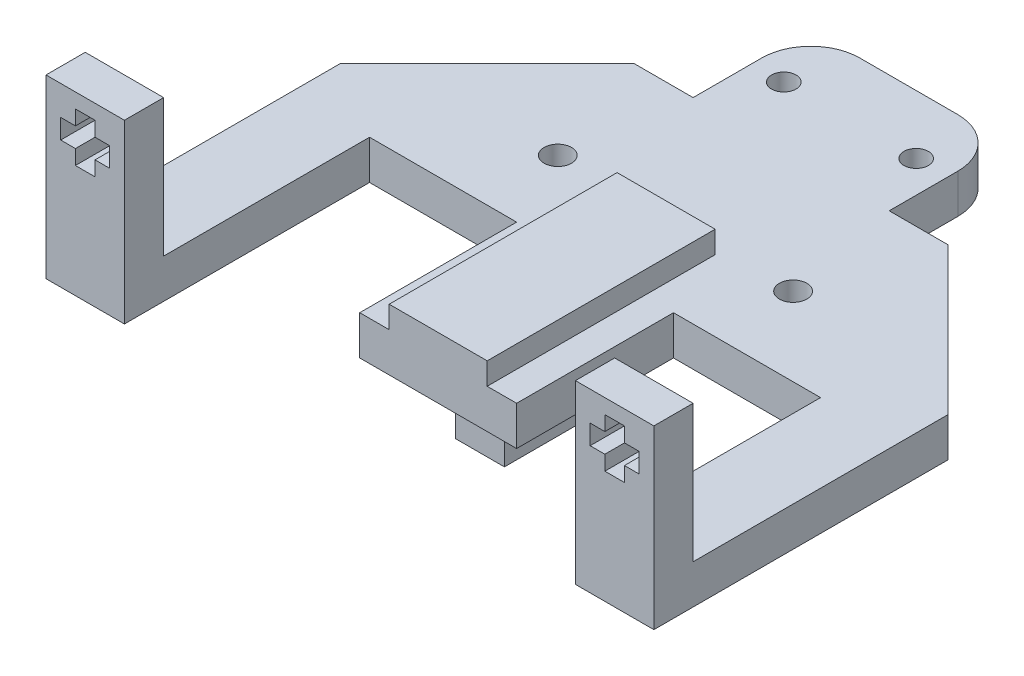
ISO-10303-21;
HEADER;
FILE_DESCRIPTION(('STEP AP214'),'2;1');
FILE_NAME('part.step','',(''),(''),'','','');
FILE_SCHEMA(('AUTOMOTIVE_DESIGN { 1 0 10303 214 1 1 1 1 }'));
ENDSEC;
DATA;
#1=APPLICATION_CONTEXT('core data for automotive mechanical design processes');
#2=APPLICATION_PROTOCOL_DEFINITION('international standard','automotive_design',2000,#1);
#3=PRODUCT_CONTEXT('',#1,'mechanical');
#4=PRODUCT('Part','Part','',(#3));
#5=PRODUCT_RELATED_PRODUCT_CATEGORY('part','',(#4));
#6=PRODUCT_DEFINITION_FORMATION('','',#4);
#7=PRODUCT_DEFINITION_CONTEXT('part definition',#1,'design');
#8=PRODUCT_DEFINITION('design','',#6,#7);
#9=PRODUCT_DEFINITION_SHAPE('','',#8);
#10=(LENGTH_UNIT() NAMED_UNIT(*) SI_UNIT(.MILLI.,.METRE.));
#11=(NAMED_UNIT(*) PLANE_ANGLE_UNIT() SI_UNIT($,.RADIAN.));
#12=(NAMED_UNIT(*) SI_UNIT($,.STERADIAN.) SOLID_ANGLE_UNIT());
#13=UNCERTAINTY_MEASURE_WITH_UNIT(LENGTH_MEASURE(1.E-05),#10,'distance_accuracy_value','');
#14=(GEOMETRIC_REPRESENTATION_CONTEXT(3) GLOBAL_UNCERTAINTY_ASSIGNED_CONTEXT((#13)) GLOBAL_UNIT_ASSIGNED_CONTEXT((#10,
#11,#12)) REPRESENTATION_CONTEXT('',''));
#15=CARTESIAN_POINT('',(0.,0.,0.));
#16=DIRECTION('',(0.,0.,1.));
#17=DIRECTION('',(1.,0.,0.));
#18=AXIS2_PLACEMENT_3D('',#15,#16,#17);
#19=CARTESIAN_POINT('',(0.0335442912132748,-13.,-30.0379017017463));
#20=DIRECTION('',(1.,0.,0.));
#21=DIRECTION('',(0.,0.,-1.));
#22=AXIS2_PLACEMENT_3D('',#19,#20,#21);
#23=PLANE('',#22);
#24=DIRECTION('',(0.,0.,-1.));
#25=VECTOR('',#24,1.);
#26=CARTESIAN_POINT('',(0.0335442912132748,-9.,-30.0379017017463));
#27=LINE('',#26,#25);
#28=CARTESIAN_POINT('',(0.0335442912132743,-9.,-25.0379017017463));
#29=VERTEX_POINT('',#28);
#30=CARTESIAN_POINT('',(0.0335442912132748,-9.,-30.0379017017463));
#31=VERTEX_POINT('',#30);
#32=EDGE_CURVE('E507',#29,#31,#27,.T.);
#33=ORIENTED_EDGE('',*,*,#32,.F.);
#34=DIRECTION('',(0.,1.,0.));
#35=VECTOR('',#34,1.);
#36=CARTESIAN_POINT('',(0.0335442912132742,-13.,-25.0379017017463));
#37=LINE('',#36,#35);
#38=CARTESIAN_POINT('',(0.0335442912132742,-4.,-25.0379017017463));
#39=VERTEX_POINT('',#38);
#40=EDGE_CURVE('E486',#29,#39,#37,.T.);
#41=ORIENTED_EDGE('',*,*,#40,.T.);
#42=DIRECTION('',(0.,0.,-1.));
#43=VECTOR('',#42,1.);
#44=CARTESIAN_POINT('',(0.0335442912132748,-4.,-30.0379017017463));
#45=LINE('',#44,#43);
#46=CARTESIAN_POINT('',(0.0335442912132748,-4.,-30.0379017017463));
#47=VERTEX_POINT('',#46);
#48=EDGE_CURVE('E510',#39,#47,#45,.T.);
#49=ORIENTED_EDGE('',*,*,#48,.T.);
#50=DIRECTION('',(0.,1.,0.));
#51=VECTOR('',#50,1.);
#52=CARTESIAN_POINT('',(0.0335442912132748,-13.,-30.0379017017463));
#53=LINE('',#52,#51);
#54=EDGE_CURVE('E89',#31,#47,#53,.T.);
#55=ORIENTED_EDGE('',*,*,#54,.F.);
#56=EDGE_LOOP('',(#33,#41,#49,#55));
#57=FACE_BOUND('',#56,.T.);
#58=ADVANCED_FACE('F74',(#57),#23,.F.);
#59=CARTESIAN_POINT('',(0.,-4.,0.));
#60=DIRECTION('',(0.,1.,0.));
#61=DIRECTION('',(0.,0.,1.));
#62=AXIS2_PLACEMENT_3D('',#59,#60,#61);
#63=PLANE('',#62);
#64=CARTESIAN_POINT('',(-18.75,-4.,-42.));
#65=DIRECTION('',(0.,1.,0.));
#66=DIRECTION('',(0.,0.,1.));
#67=AXIS2_PLACEMENT_3D('',#64,#65,#66);
#68=CIRCLE('',#67,1.25);
#69=CARTESIAN_POINT('',(-18.75,-4.,-40.75));
#70=VERTEX_POINT('',#69);
#71=EDGE_CURVE('E629',#70,#70,#68,.T.);
#72=ORIENTED_EDGE('',*,*,#71,.T.);
#73=EDGE_LOOP('',(#72));
#74=FACE_BOUND('',#73,.T.);
#75=CARTESIAN_POINT('',(-5.25000000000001,-4.,-42.));
#76=DIRECTION('',(0.,1.,0.));
#77=DIRECTION('',(0.,0.,-1.));
#78=AXIS2_PLACEMENT_3D('',#75,#76,#77);
#79=CIRCLE('',#78,1.25);
#80=CARTESIAN_POINT('',(-5.25000000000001,-4.,-43.25));
#81=VERTEX_POINT('',#80);
#82=EDGE_CURVE('E623',#81,#81,#79,.T.);
#83=ORIENTED_EDGE('',*,*,#82,.T.);
#84=EDGE_LOOP('',(#83));
#85=FACE_BOUND('',#84,.T.);
#86=DIRECTION('',(1.,0.,0.));
#87=VECTOR('',#86,1.);
#88=CARTESIAN_POINT('',(0.,-4.,-16.));
#89=LINE('',#88,#87);
#90=CARTESIAN_POINT('',(-4.,-4.,-16.));
#91=VERTEX_POINT('',#90);
#92=CARTESIAN_POINT('',(11.,-4.,-16.));
#93=VERTEX_POINT('',#92);
#94=EDGE_CURVE('E887',#91,#93,#89,.T.);
#95=ORIENTED_EDGE('',*,*,#94,.F.);
#96=DIRECTION('',(0.,0.,1.));
#97=VECTOR('',#96,1.);
#98=CARTESIAN_POINT('',(-4.,-4.,0.));
#99=LINE('',#98,#97);
#100=CARTESIAN_POINT('',(-4.,-4.,0.));
#101=VERTEX_POINT('',#100);
#102=EDGE_CURVE('E1011',#91,#101,#99,.T.);
#103=ORIENTED_EDGE('',*,*,#102,.T.);
#104=DIRECTION('',(-1.,0.,0.));
#105=VECTOR('',#104,1.);
#106=CARTESIAN_POINT('',(0.,-4.,0.));
#107=LINE('',#106,#105);
#108=CARTESIAN_POINT('',(-20.,-4.,0.));
#109=VERTEX_POINT('',#108);
#110=EDGE_CURVE('E958',#101,#109,#107,.T.);
#111=ORIENTED_EDGE('',*,*,#110,.T.);
#112=DIRECTION('',(0.,0.,-1.));
#113=VECTOR('',#112,1.);
#114=CARTESIAN_POINT('',(-20.,-4.,0.));
#115=LINE('',#114,#113);
#116=CARTESIAN_POINT('',(-20.,-4.,-16.));
#117=VERTEX_POINT('',#116);
#118=EDGE_CURVE('E1004',#109,#117,#115,.T.);
#119=ORIENTED_EDGE('',*,*,#118,.T.);
#120=DIRECTION('',(-1.,0.,0.));
#121=VECTOR('',#120,1.);
#122=CARTESIAN_POINT('',(0.,-4.,-16.));
#123=LINE('',#122,#121);
#124=CARTESIAN_POINT('',(-35.,-4.,-16.));
#125=VERTEX_POINT('',#124);
#126=EDGE_CURVE('E1828',#117,#125,#123,.T.);
#127=ORIENTED_EDGE('',*,*,#126,.T.);
#128=DIRECTION('',(0.,0.,1.));
#129=VECTOR('',#128,1.);
#130=CARTESIAN_POINT('',(-35.,-4.,0.));
#131=LINE('',#130,#129);
#132=CARTESIAN_POINT('',(-35.,-4.,9.00000000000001));
#133=VERTEX_POINT('',#132);
#134=EDGE_CURVE('E1820',#125,#133,#131,.T.);
#135=ORIENTED_EDGE('',*,*,#134,.T.);
#136=DIRECTION('',(-1.,0.,0.));
#137=VECTOR('',#136,1.);
#138=CARTESIAN_POINT('',(0.,-4.,9.));
#139=LINE('',#138,#137);
#140=CARTESIAN_POINT('',(-43.,-4.,9.00000000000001));
#141=VERTEX_POINT('',#140);
#142=EDGE_CURVE('E1823',#133,#141,#139,.T.);
#143=ORIENTED_EDGE('',*,*,#142,.T.);
#144=DIRECTION('',(0.,0.,1.));
#145=VECTOR('',#144,1.);
#146=CARTESIAN_POINT('',(-43.,-4.,0.));
#147=LINE('',#146,#145);
#148=CARTESIAN_POINT('',(-43.,-4.,-20.9999999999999));
#149=VERTEX_POINT('',#148);
#150=EDGE_CURVE('E1826',#149,#141,#147,.T.);
#151=ORIENTED_EDGE('',*,*,#150,.F.);
#152=DIRECTION('',(0.707106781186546,0.,-0.707106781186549));
#153=VECTOR('',#152,1.);
#154=CARTESIAN_POINT('',(-28.,-4.,-36.));
#155=LINE('',#154,#153);
#156=CARTESIAN_POINT('',(-28.,-4.,-36.));
#157=VERTEX_POINT('',#156);
#158=EDGE_CURVE('E1002',#149,#157,#155,.T.);
#159=ORIENTED_EDGE('',*,*,#158,.T.);
#160=DIRECTION('',(1.,0.,0.));
#161=VECTOR('',#160,1.);
#162=CARTESIAN_POINT('',(0.,-4.,-36.));
#163=LINE('',#162,#161);
#164=CARTESIAN_POINT('',(-22.,-4.,-36.));
#165=VERTEX_POINT('',#164);
#166=EDGE_CURVE('E1830',#157,#165,#163,.T.);
#167=ORIENTED_EDGE('',*,*,#166,.T.);
#168=DIRECTION('',(0.,0.,1.));
#169=VECTOR('',#168,1.);
#170=CARTESIAN_POINT('',(-22.,-4.,-48.));
#171=LINE('',#170,#169);
#172=CARTESIAN_POINT('',(-22.,-4.,-43.));
#173=VERTEX_POINT('',#172);
#174=EDGE_CURVE('E635',#173,#165,#171,.T.);
#175=ORIENTED_EDGE('',*,*,#174,.F.);
#176=CARTESIAN_POINT('',(-17.,-4.,-43.));
#177=DIRECTION('',(0.,1.,0.));
#178=DIRECTION('',(0.,0.,1.));
#179=AXIS2_PLACEMENT_3D('',#176,#177,#178);
#180=CIRCLE('',#179,5.);
#181=CARTESIAN_POINT('',(-17.,-4.,-48.));
#182=VERTEX_POINT('',#181);
#183=EDGE_CURVE('E912',#173,#182,#180,.F.);
#184=ORIENTED_EDGE('',*,*,#183,.T.);
#185=DIRECTION('',(-1.,0.,0.));
#186=VECTOR('',#185,1.);
#187=CARTESIAN_POINT('',(-22.,-4.,-48.));
#188=LINE('',#187,#186);
#189=CARTESIAN_POINT('',(-7.00000000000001,-4.,-48.));
#190=VERTEX_POINT('',#189);
#191=EDGE_CURVE('E642',#190,#182,#188,.T.);
#192=ORIENTED_EDGE('',*,*,#191,.F.);
#193=CARTESIAN_POINT('',(-7.00000000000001,-4.,-43.));
#194=DIRECTION('',(0.,1.,0.));
#195=DIRECTION('',(0.,0.,1.));
#196=AXIS2_PLACEMENT_3D('',#193,#194,#195);
#197=CIRCLE('',#196,5.);
#198=CARTESIAN_POINT('',(-2.00000000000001,-4.,-43.));
#199=VERTEX_POINT('',#198);
#200=EDGE_CURVE('E914',#190,#199,#197,.F.);
#201=ORIENTED_EDGE('',*,*,#200,.T.);
#202=DIRECTION('',(0.,0.,-1.));
#203=VECTOR('',#202,1.);
#204=CARTESIAN_POINT('',(-2.00000000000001,-4.,-48.));
#205=LINE('',#204,#203);
#206=CARTESIAN_POINT('',(-2.00000000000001,-4.,-36.));
#207=VERTEX_POINT('',#206);
#208=EDGE_CURVE('E638',#207,#199,#205,.T.);
#209=ORIENTED_EDGE('',*,*,#208,.F.);
#210=CARTESIAN_POINT('',(3.99999999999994,-4.,-36.));
#211=VERTEX_POINT('',#210);
#212=EDGE_CURVE('E995',#207,#211,#163,.T.);
#213=ORIENTED_EDGE('',*,*,#212,.T.);
#214=DIRECTION('',(-0.707106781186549,0.,-0.707106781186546));
#215=VECTOR('',#214,1.);
#216=CARTESIAN_POINT('',(19.,-4.,-21.));
#217=LINE('',#216,#215);
#218=CARTESIAN_POINT('',(19.,-4.,-21.));
#219=VERTEX_POINT('',#218);
#220=EDGE_CURVE('E1000',#211,#219,#217,.F.);
#221=ORIENTED_EDGE('',*,*,#220,.T.);
#222=DIRECTION('',(0.,0.,1.));
#223=VECTOR('',#222,1.);
#224=CARTESIAN_POINT('',(19.,-4.,0.));
#225=LINE('',#224,#223);
#226=CARTESIAN_POINT('',(19.,-4.,9.00000000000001));
#227=VERTEX_POINT('',#226);
#228=EDGE_CURVE('E991',#219,#227,#225,.T.);
#229=ORIENTED_EDGE('',*,*,#228,.T.);
#230=DIRECTION('',(-1.,0.,0.));
#231=VECTOR('',#230,1.);
#232=CARTESIAN_POINT('',(0.,-4.,9.00000000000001));
#233=LINE('',#232,#231);
#234=CARTESIAN_POINT('',(11.,-4.,9.00000000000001));
#235=VERTEX_POINT('',#234);
#236=EDGE_CURVE('E990',#227,#235,#233,.T.);
#237=ORIENTED_EDGE('',*,*,#236,.T.);
#238=DIRECTION('',(0.,0.,1.));
#239=VECTOR('',#238,1.);
#240=CARTESIAN_POINT('',(11.,-4.,0.));
#241=LINE('',#240,#239);
#242=EDGE_CURVE('E1854',#93,#235,#241,.T.);
#243=ORIENTED_EDGE('',*,*,#242,.F.);
#244=EDGE_LOOP('',(#95,#103,#111,#119,#127,#135,#143,#151,#159,#167,#175,#184,#192,#201,#209,
#213,#221,#229,#237,#243));
#245=FACE_BOUND('',#244,.T.);
#246=DIRECTION('',(1.,0.,0.));
#247=VECTOR('',#246,1.);
#248=CARTESIAN_POINT('',(0.,-4.,-6.75503767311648));
#249=LINE('',#248,#247);
#250=CARTESIAN_POINT('',(-17.,-4.,-6.75503767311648));
#251=VERTEX_POINT('',#250);
#252=CARTESIAN_POINT('',(-12.,-4.,-6.75503767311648));
#253=VERTEX_POINT('',#252);
#254=EDGE_CURVE('E1014',#251,#253,#249,.T.);
#255=ORIENTED_EDGE('',*,*,#254,.T.);
#256=DIRECTION('',(0.,0.,-1.));
#257=VECTOR('',#256,1.);
#258=CARTESIAN_POINT('',(-12.,-4.,0.));
#259=LINE('',#258,#257);
#260=CARTESIAN_POINT('',(-12.,-4.,-10.));
#261=VERTEX_POINT('',#260);
#262=EDGE_CURVE('E12',#253,#261,#259,.T.);
#263=ORIENTED_EDGE('',*,*,#262,.T.);
#264=DIRECTION('',(-1.,0.,0.));
#265=VECTOR('',#264,1.);
#266=CARTESIAN_POINT('',(0.,-4.,-10.));
#267=LINE('',#266,#265);
#268=CARTESIAN_POINT('',(-17.,-4.,-10.));
#269=VERTEX_POINT('',#268);
#270=EDGE_CURVE('E82',#261,#269,#267,.T.);
#271=ORIENTED_EDGE('',*,*,#270,.T.);
#272=DIRECTION('',(0.,0.,1.));
#273=VECTOR('',#272,1.);
#274=CARTESIAN_POINT('',(-17.,-4.,0.));
#275=LINE('',#274,#273);
#276=EDGE_CURVE('E1017',#269,#251,#275,.T.);
#277=ORIENTED_EDGE('',*,*,#276,.T.);
#278=EDGE_LOOP('',(#255,#263,#271,#277));
#279=FACE_BOUND('',#278,.T.);
#280=ORIENTED_EDGE('',*,*,#48,.F.);
#281=DIRECTION('',(-1.,0.,0.));
#282=VECTOR('',#281,1.);
#283=CARTESIAN_POINT('',(0.0335442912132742,-4.,-25.0379017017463));
#284=LINE('',#283,#282);
#285=CARTESIAN_POINT('',(3.03354429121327,-4.,-25.0379017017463));
#286=VERTEX_POINT('',#285);
#287=EDGE_CURVE('E514',#286,#39,#284,.T.);
#288=ORIENTED_EDGE('',*,*,#287,.F.);
#289=DIRECTION('',(0.,0.,1.));
#290=VECTOR('',#289,1.);
#291=CARTESIAN_POINT('',(3.03354429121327,-4.,-30.0379017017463));
#292=LINE('',#291,#290);
#293=CARTESIAN_POINT('',(3.03354429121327,-4.,-30.0379017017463));
#294=VERTEX_POINT('',#293);
#295=EDGE_CURVE('E522',#294,#286,#292,.T.);
#296=ORIENTED_EDGE('',*,*,#295,.F.);
#297=DIRECTION('',(1.,0.,0.));
#298=VECTOR('',#297,1.);
#299=CARTESIAN_POINT('',(0.0335442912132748,-4.,-30.0379017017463));
#300=LINE('',#299,#298);
#301=EDGE_CURVE('E520',#47,#294,#300,.T.);
#302=ORIENTED_EDGE('',*,*,#301,.F.);
#303=EDGE_LOOP('',(#280,#288,#296,#302));
#304=FACE_BOUND('',#303,.T.);
#305=ADVANCED_FACE('F1021',(#74,#85,#245,#279,#304),#63,.F.);
#306=CARTESIAN_POINT('',(0.,0.,0.));
#307=DIRECTION('',(0.,1.,0.));
#308=DIRECTION('',(0.,0.,1.));
#309=AXIS2_PLACEMENT_3D('',#306,#307,#308);
#310=PLANE('',#309);
#311=CARTESIAN_POINT('',(0.200000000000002,0.,-24.));
#312=DIRECTION('',(0.,1.,0.));
#313=DIRECTION('',(0.,0.,1.));
#314=AXIS2_PLACEMENT_3D('',#311,#312,#313);
#315=CIRCLE('',#314,1.4);
#316=CARTESIAN_POINT('',(0.200000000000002,0.,-22.6));
#317=VERTEX_POINT('',#316);
#318=EDGE_CURVE('E560',#317,#317,#315,.T.);
#319=ORIENTED_EDGE('',*,*,#318,.F.);
#320=EDGE_LOOP('',(#319));
#321=FACE_BOUND('',#320,.T.);
#322=CARTESIAN_POINT('',(-23.8,0.,-24.));
#323=DIRECTION('',(0.,1.,0.));
#324=DIRECTION('',(0.,0.,1.));
#325=AXIS2_PLACEMENT_3D('',#322,#323,#324);
#326=CIRCLE('',#325,1.4);
#327=CARTESIAN_POINT('',(-23.8,0.,-22.6));
#328=VERTEX_POINT('',#327);
#329=EDGE_CURVE('E571',#328,#328,#326,.T.);
#330=ORIENTED_EDGE('',*,*,#329,.F.);
#331=EDGE_LOOP('',(#330));
#332=FACE_BOUND('',#331,.T.);
#333=CARTESIAN_POINT('',(-18.75,0.,-42.));
#334=DIRECTION('',(0.,1.,0.));
#335=DIRECTION('',(0.,0.,1.));
#336=AXIS2_PLACEMENT_3D('',#333,#334,#335);
#337=CIRCLE('',#336,1.25);
#338=CARTESIAN_POINT('',(-18.75,0.,-40.75));
#339=VERTEX_POINT('',#338);
#340=EDGE_CURVE('E626',#339,#339,#337,.T.);
#341=ORIENTED_EDGE('',*,*,#340,.F.);
#342=EDGE_LOOP('',(#341));
#343=FACE_BOUND('',#342,.T.);
#344=CARTESIAN_POINT('',(-5.25000000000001,0.,-42.));
#345=DIRECTION('',(0.,1.,0.));
#346=DIRECTION('',(0.,0.,-1.));
#347=AXIS2_PLACEMENT_3D('',#344,#345,#346);
#348=CIRCLE('',#347,1.25);
#349=CARTESIAN_POINT('',(-5.25000000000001,0.,-43.25));
#350=VERTEX_POINT('',#349);
#351=EDGE_CURVE('E620',#350,#350,#348,.T.);
#352=ORIENTED_EDGE('',*,*,#351,.F.);
#353=EDGE_LOOP('',(#352));
#354=FACE_BOUND('',#353,.T.);
#355=DIRECTION('',(-1.,0.,0.));
#356=VECTOR('',#355,1.);
#357=CARTESIAN_POINT('',(0.,0.,0.));
#358=LINE('',#357,#356);
#359=CARTESIAN_POINT('',(-17.,0.,0.));
#360=VERTEX_POINT('',#359);
#361=CARTESIAN_POINT('',(-20.,0.,0.));
#362=VERTEX_POINT('',#361);
#363=EDGE_CURVE('E942',#360,#362,#358,.T.);
#364=ORIENTED_EDGE('',*,*,#363,.F.);
#365=DIRECTION('',(0.,0.,1.));
#366=VECTOR('',#365,1.);
#367=CARTESIAN_POINT('',(-17.,0.,0.));
#368=LINE('',#367,#366);
#369=CARTESIAN_POINT('',(-17.,0.,-23.2483915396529));
#370=VERTEX_POINT('',#369);
#371=EDGE_CURVE('E577',#370,#360,#368,.T.);
#372=ORIENTED_EDGE('',*,*,#371,.F.);
#373=DIRECTION('',(-1.,0.,0.));
#374=VECTOR('',#373,1.);
#375=CARTESIAN_POINT('',(-17.,0.,-23.2483915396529));
#376=LINE('',#375,#374);
#377=CARTESIAN_POINT('',(-7.,0.,-23.2483915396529));
#378=VERTEX_POINT('',#377);
#379=EDGE_CURVE('E584',#378,#370,#376,.T.);
#380=ORIENTED_EDGE('',*,*,#379,.F.);
#381=DIRECTION('',(0.,0.,-1.));
#382=VECTOR('',#381,1.);
#383=CARTESIAN_POINT('',(-7.,0.,0.));
#384=LINE('',#383,#382);
#385=CARTESIAN_POINT('',(-7.,0.,0.));
#386=VERTEX_POINT('',#385);
#387=EDGE_CURVE('E592',#386,#378,#384,.T.);
#388=ORIENTED_EDGE('',*,*,#387,.F.);
#389=CARTESIAN_POINT('',(-4.,0.,0.));
#390=VERTEX_POINT('',#389);
#391=EDGE_CURVE('E943',#390,#386,#358,.T.);
#392=ORIENTED_EDGE('',*,*,#391,.F.);
#393=DIRECTION('',(0.,0.,1.));
#394=VECTOR('',#393,1.);
#395=CARTESIAN_POINT('',(-4.,0.,-16.));
#396=LINE('',#395,#394);
#397=CARTESIAN_POINT('',(-4.,0.,-16.));
#398=VERTEX_POINT('',#397);
#399=EDGE_CURVE('E605',#398,#390,#396,.T.);
#400=ORIENTED_EDGE('',*,*,#399,.F.);
#401=DIRECTION('',(1.,0.,0.));
#402=VECTOR('',#401,1.);
#403=CARTESIAN_POINT('',(0.,0.,-16.));
#404=LINE('',#403,#402);
#405=CARTESIAN_POINT('',(11.,0.,-16.));
#406=VERTEX_POINT('',#405);
#407=EDGE_CURVE('E882',#398,#406,#404,.T.);
#408=ORIENTED_EDGE('',*,*,#407,.T.);
#409=DIRECTION('',(0.,0.,1.));
#410=VECTOR('',#409,1.);
#411=CARTESIAN_POINT('',(11.,0.,0.));
#412=LINE('',#411,#410);
#413=CARTESIAN_POINT('',(11.,0.,5.00000000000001));
#414=VERTEX_POINT('',#413);
#415=EDGE_CURVE('E926',#406,#414,#412,.T.);
#416=ORIENTED_EDGE('',*,*,#415,.T.);
#417=DIRECTION('',(1.,0.,0.));
#418=VECTOR('',#417,1.);
#419=CARTESIAN_POINT('',(11.,0.,5.00000000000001));
#420=LINE('',#419,#418);
#421=CARTESIAN_POINT('',(19.,0.,5.00000000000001));
#422=VERTEX_POINT('',#421);
#423=EDGE_CURVE('E874',#414,#422,#420,.T.);
#424=ORIENTED_EDGE('',*,*,#423,.T.);
#425=DIRECTION('',(0.,0.,1.));
#426=VECTOR('',#425,1.);
#427=CARTESIAN_POINT('',(19.,0.,0.));
#428=LINE('',#427,#426);
#429=CARTESIAN_POINT('',(19.,0.,-21.));
#430=VERTEX_POINT('',#429);
#431=EDGE_CURVE('E922',#430,#422,#428,.T.);
#432=ORIENTED_EDGE('',*,*,#431,.F.);
#433=DIRECTION('',(0.707106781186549,0.,0.707106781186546));
#434=VECTOR('',#433,1.);
#435=CARTESIAN_POINT('',(20.,0.,-20.0000000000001));
#436=LINE('',#435,#434);
#437=CARTESIAN_POINT('',(3.99999999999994,0.,-36.));
#438=VERTEX_POINT('',#437);
#439=EDGE_CURVE('E921',#430,#438,#436,.F.);
#440=ORIENTED_EDGE('',*,*,#439,.T.);
#441=DIRECTION('',(1.,0.,0.));
#442=VECTOR('',#441,1.);
#443=CARTESIAN_POINT('',(0.,0.,-36.));
#444=LINE('',#443,#442);
#445=CARTESIAN_POINT('',(-2.00000000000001,0.,-36.));
#446=VERTEX_POINT('',#445);
#447=EDGE_CURVE('E925',#446,#438,#444,.T.);
#448=ORIENTED_EDGE('',*,*,#447,.F.);
#449=DIRECTION('',(0.,0.,-1.));
#450=VECTOR('',#449,1.);
#451=CARTESIAN_POINT('',(-2.00000000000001,0.,-48.));
#452=LINE('',#451,#450);
#453=CARTESIAN_POINT('',(-2.00000000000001,0.,-43.));
#454=VERTEX_POINT('',#453);
#455=EDGE_CURVE('E648',#446,#454,#452,.T.);
#456=ORIENTED_EDGE('',*,*,#455,.T.);
#457=CARTESIAN_POINT('',(-7.00000000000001,0.,-43.));
#458=DIRECTION('',(0.,1.,0.));
#459=DIRECTION('',(0.,0.,1.));
#460=AXIS2_PLACEMENT_3D('',#457,#458,#459);
#461=CIRCLE('',#460,5.);
#462=CARTESIAN_POINT('',(-7.00000000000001,0.,-48.));
#463=VERTEX_POINT('',#462);
#464=EDGE_CURVE('E905',#454,#463,#461,.T.);
#465=ORIENTED_EDGE('',*,*,#464,.T.);
#466=DIRECTION('',(-1.,0.,0.));
#467=VECTOR('',#466,1.);
#468=CARTESIAN_POINT('',(-22.,0.,-48.));
#469=LINE('',#468,#467);
#470=CARTESIAN_POINT('',(-17.,0.,-48.));
#471=VERTEX_POINT('',#470);
#472=EDGE_CURVE('E639',#463,#471,#469,.T.);
#473=ORIENTED_EDGE('',*,*,#472,.T.);
#474=CARTESIAN_POINT('',(-17.,0.,-43.));
#475=DIRECTION('',(0.,1.,0.));
#476=DIRECTION('',(0.,0.,1.));
#477=AXIS2_PLACEMENT_3D('',#474,#475,#476);
#478=CIRCLE('',#477,5.);
#479=CARTESIAN_POINT('',(-22.,0.,-43.));
#480=VERTEX_POINT('',#479);
#481=EDGE_CURVE('E902',#471,#480,#478,.T.);
#482=ORIENTED_EDGE('',*,*,#481,.T.);
#483=DIRECTION('',(0.,0.,1.));
#484=VECTOR('',#483,1.);
#485=CARTESIAN_POINT('',(-22.,0.,-48.));
#486=LINE('',#485,#484);
#487=CARTESIAN_POINT('',(-22.,0.,-36.));
#488=VERTEX_POINT('',#487);
#489=EDGE_CURVE('E632',#480,#488,#486,.T.);
#490=ORIENTED_EDGE('',*,*,#489,.T.);
#491=CARTESIAN_POINT('',(-28.,0.,-36.));
#492=VERTEX_POINT('',#491);
#493=EDGE_CURVE('E933',#492,#488,#444,.T.);
#494=ORIENTED_EDGE('',*,*,#493,.F.);
#495=DIRECTION('',(-0.707106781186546,0.,0.707106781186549));
#496=VECTOR('',#495,1.);
#497=CARTESIAN_POINT('',(-32.,0.,-31.9999999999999));
#498=LINE('',#497,#496);
#499=CARTESIAN_POINT('',(-43.,0.,-20.9999999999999));
#500=VERTEX_POINT('',#499);
#501=EDGE_CURVE('E1865',#492,#500,#498,.T.);
#502=ORIENTED_EDGE('',*,*,#501,.T.);
#503=DIRECTION('',(0.,0.,1.));
#504=VECTOR('',#503,1.);
#505=CARTESIAN_POINT('',(-43.,0.,0.));
#506=LINE('',#505,#504);
#507=CARTESIAN_POINT('',(-43.,0.,5.00000000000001));
#508=VERTEX_POINT('',#507);
#509=EDGE_CURVE('E935',#500,#508,#506,.T.);
#510=ORIENTED_EDGE('',*,*,#509,.T.);
#511=DIRECTION('',(-1.,0.,0.));
#512=VECTOR('',#511,1.);
#513=CARTESIAN_POINT('',(-35.,0.,5.00000000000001));
#514=LINE('',#513,#512);
#515=CARTESIAN_POINT('',(-35.,0.,5.00000000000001));
#516=VERTEX_POINT('',#515);
#517=EDGE_CURVE('E862',#516,#508,#514,.T.);
#518=ORIENTED_EDGE('',*,*,#517,.F.);
#519=DIRECTION('',(0.,0.,1.));
#520=VECTOR('',#519,1.);
#521=CARTESIAN_POINT('',(-35.,0.,0.));
#522=LINE('',#521,#520);
#523=CARTESIAN_POINT('',(-35.,0.,-16.));
#524=VERTEX_POINT('',#523);
#525=EDGE_CURVE('E937',#524,#516,#522,.T.);
#526=ORIENTED_EDGE('',*,*,#525,.F.);
#527=DIRECTION('',(-1.,0.,0.));
#528=VECTOR('',#527,1.);
#529=CARTESIAN_POINT('',(0.,0.,-16.));
#530=LINE('',#529,#528);
#531=CARTESIAN_POINT('',(-20.,0.,-16.));
#532=VERTEX_POINT('',#531);
#533=EDGE_CURVE('E940',#532,#524,#530,.T.);
#534=ORIENTED_EDGE('',*,*,#533,.F.);
#535=DIRECTION('',(0.,0.,-1.));
#536=VECTOR('',#535,1.);
#537=CARTESIAN_POINT('',(-20.,0.,-16.));
#538=LINE('',#537,#536);
#539=EDGE_CURVE('E611',#362,#532,#538,.T.);
#540=ORIENTED_EDGE('',*,*,#539,.F.);
#541=EDGE_LOOP('',(#364,#372,#380,#388,#392,#400,#408,#416,#424,#432,#440,#448,#456,#465,#473,
#482,#490,#494,#502,#510,#518,#526,#534,#540));
#542=FACE_BOUND('',#541,.T.);
#543=ADVANCED_FACE('F974',(#321,#332,#343,#354,#542),#310,.T.);
#544=CARTESIAN_POINT('',(0.,-4.,-36.));
#545=DIRECTION('',(0.,0.,1.));
#546=DIRECTION('',(1.,0.,0.));
#547=AXIS2_PLACEMENT_3D('',#544,#545,#546);
#548=PLANE('',#547);
#549=ORIENTED_EDGE('',*,*,#166,.F.);
#550=DIRECTION('',(0.,1.,0.));
#551=VECTOR('',#550,1.);
#552=CARTESIAN_POINT('',(-28.,0.,-36.));
#553=LINE('',#552,#551);
#554=EDGE_CURVE('E918',#157,#492,#553,.T.);
#555=ORIENTED_EDGE('',*,*,#554,.T.);
#556=ORIENTED_EDGE('',*,*,#493,.T.);
#557=DIRECTION('',(0.,-1.,0.));
#558=VECTOR('',#557,1.);
#559=CARTESIAN_POINT('',(-22.,-4.,-36.));
#560=LINE('',#559,#558);
#561=EDGE_CURVE('E655',#488,#165,#560,.T.);
#562=ORIENTED_EDGE('',*,*,#561,.T.);
#563=EDGE_LOOP('',(#549,#555,#556,#562));
#564=FACE_BOUND('',#563,.T.);
#565=ADVANCED_FACE('F1206',(#564),#548,.F.);
#566=CARTESIAN_POINT('',(0.,-4.,9.));
#567=DIRECTION('',(0.,0.,-1.));
#568=DIRECTION('',(-1.,0.,0.));
#569=AXIS2_PLACEMENT_3D('',#566,#567,#568);
#570=PLANE('',#569);
#571=DIRECTION('',(0.,1.,0.));
#572=VECTOR('',#571,1.);
#573=CARTESIAN_POINT('',(-35.,-4.,9.00000000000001));
#574=LINE('',#573,#572);
#575=CARTESIAN_POINT('',(-35.,14.,9.00000000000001));
#576=VERTEX_POINT('',#575);
#577=EDGE_CURVE('E948',#133,#576,#574,.T.);
#578=ORIENTED_EDGE('',*,*,#577,.T.);
#579=DIRECTION('',(-1.,0.,0.));
#580=VECTOR('',#579,1.);
#581=CARTESIAN_POINT('',(-35.,14.,9.00000000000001));
#582=LINE('',#581,#580);
#583=CARTESIAN_POINT('',(-43.,14.,9.00000000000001));
#584=VERTEX_POINT('',#583);
#585=EDGE_CURVE('E858',#576,#584,#582,.T.);
#586=ORIENTED_EDGE('',*,*,#585,.T.);
#587=DIRECTION('',(0.,1.,0.));
#588=VECTOR('',#587,1.);
#589=CARTESIAN_POINT('',(-43.,-4.,9.00000000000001));
#590=LINE('',#589,#588);
#591=EDGE_CURVE('E950',#141,#584,#590,.T.);
#592=ORIENTED_EDGE('',*,*,#591,.F.);
#593=ORIENTED_EDGE('',*,*,#142,.F.);
#594=EDGE_LOOP('',(#578,#586,#592,#593));
#595=FACE_BOUND('',#594,.T.);
#596=DIRECTION('',(0.,1.,0.));
#597=VECTOR('',#596,1.);
#598=CARTESIAN_POINT('',(-41.4999999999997,-1.15185638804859E-12,9.));
#599=LINE('',#598,#597);
#600=CARTESIAN_POINT('',(-41.5,8.99999999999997,9.00000000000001));
#601=VERTEX_POINT('',#600);
#602=CARTESIAN_POINT('',(-41.5,11.,9.));
#603=VERTEX_POINT('',#602);
#604=EDGE_CURVE('E787',#601,#603,#599,.T.);
#605=ORIENTED_EDGE('',*,*,#604,.T.);
#606=DIRECTION('',(1.,0.,0.));
#607=VECTOR('',#606,1.);
#608=CARTESIAN_POINT('',(0.,11.,9.));
#609=LINE('',#608,#607);
#610=CARTESIAN_POINT('',(-40.,11.,9.));
#611=VERTEX_POINT('',#610);
#612=EDGE_CURVE('E820',#603,#611,#609,.T.);
#613=ORIENTED_EDGE('',*,*,#612,.T.);
#614=DIRECTION('',(0.,1.,0.));
#615=VECTOR('',#614,1.);
#616=CARTESIAN_POINT('',(-40.,0.,9.));
#617=LINE('',#616,#615);
#618=CARTESIAN_POINT('',(-40.,12.5,9.));
#619=VERTEX_POINT('',#618);
#620=EDGE_CURVE('E817',#611,#619,#617,.T.);
#621=ORIENTED_EDGE('',*,*,#620,.T.);
#622=DIRECTION('',(1.,0.,0.));
#623=VECTOR('',#622,1.);
#624=CARTESIAN_POINT('',(0.,12.5,9.));
#625=LINE('',#624,#623);
#626=CARTESIAN_POINT('',(-38.,12.5,9.));
#627=VERTEX_POINT('',#626);
#628=EDGE_CURVE('E814',#619,#627,#625,.T.);
#629=ORIENTED_EDGE('',*,*,#628,.T.);
#630=DIRECTION('',(0.,-1.,0.));
#631=VECTOR('',#630,1.);
#632=CARTESIAN_POINT('',(-38.,0.,9.));
#633=LINE('',#632,#631);
#634=CARTESIAN_POINT('',(-38.,11.,9.));
#635=VERTEX_POINT('',#634);
#636=EDGE_CURVE('E811',#627,#635,#633,.T.);
#637=ORIENTED_EDGE('',*,*,#636,.T.);
#638=DIRECTION('',(1.,0.,0.));
#639=VECTOR('',#638,1.);
#640=CARTESIAN_POINT('',(0.,11.,9.));
#641=LINE('',#640,#639);
#642=CARTESIAN_POINT('',(-36.5,11.,9.));
#643=VERTEX_POINT('',#642);
#644=EDGE_CURVE('E808',#635,#643,#641,.T.);
#645=ORIENTED_EDGE('',*,*,#644,.T.);
#646=DIRECTION('',(0.,-1.,0.));
#647=VECTOR('',#646,1.);
#648=CARTESIAN_POINT('',(-36.5,2.53269627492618E-13,9.));
#649=LINE('',#648,#647);
#650=CARTESIAN_POINT('',(-36.5,9.,9.));
#651=VERTEX_POINT('',#650);
#652=EDGE_CURVE('E805',#643,#651,#649,.T.);
#653=ORIENTED_EDGE('',*,*,#652,.T.);
#654=DIRECTION('',(-1.,0.,0.));
#655=VECTOR('',#654,1.);
#656=CARTESIAN_POINT('',(0.,9.,9.));
#657=LINE('',#656,#655);
#658=CARTESIAN_POINT('',(-38.,9.,9.));
#659=VERTEX_POINT('',#658);
#660=EDGE_CURVE('E802',#651,#659,#657,.T.);
#661=ORIENTED_EDGE('',*,*,#660,.T.);
#662=DIRECTION('',(0.,-1.,0.));
#663=VECTOR('',#662,1.);
#664=CARTESIAN_POINT('',(-38.,0.,9.));
#665=LINE('',#664,#663);
#666=CARTESIAN_POINT('',(-38.,7.5,9.));
#667=VERTEX_POINT('',#666);
#668=EDGE_CURVE('E799',#659,#667,#665,.T.);
#669=ORIENTED_EDGE('',*,*,#668,.T.);
#670=DIRECTION('',(-1.,0.,0.));
#671=VECTOR('',#670,1.);
#672=CARTESIAN_POINT('',(0.,7.50000000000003,9.));
#673=LINE('',#672,#671);
#674=CARTESIAN_POINT('',(-40.,7.49999999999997,9.));
#675=VERTEX_POINT('',#674);
#676=EDGE_CURVE('E796',#667,#675,#673,.T.);
#677=ORIENTED_EDGE('',*,*,#676,.T.);
#678=DIRECTION('',(0.,1.,0.));
#679=VECTOR('',#678,1.);
#680=CARTESIAN_POINT('',(-40.,0.,9.));
#681=LINE('',#680,#679);
#682=CARTESIAN_POINT('',(-40.,8.99999999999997,9.));
#683=VERTEX_POINT('',#682);
#684=EDGE_CURVE('E793',#675,#683,#681,.T.);
#685=ORIENTED_EDGE('',*,*,#684,.T.);
#686=DIRECTION('',(-1.,0.,0.));
#687=VECTOR('',#686,1.);
#688=CARTESIAN_POINT('',(0.,8.99999999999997,9.));
#689=LINE('',#688,#687);
#690=EDGE_CURVE('E790',#683,#601,#689,.T.);
#691=ORIENTED_EDGE('',*,*,#690,.T.);
#692=EDGE_LOOP('',(#605,#613,#621,#629,#637,#645,#653,#661,#669,#677,#685,#691));
#693=FACE_BOUND('',#692,.T.);
#694=ADVANCED_FACE('F1393',(#595,#693),#570,.F.);
#695=CARTESIAN_POINT('',(-35.,0.,5.00000000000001));
#696=DIRECTION('',(0.,0.,1.));
#697=DIRECTION('',(1.,0.,0.));
#698=AXIS2_PLACEMENT_3D('',#695,#696,#697);
#699=PLANE('',#698);
#700=DIRECTION('',(0.,1.,0.));
#701=VECTOR('',#700,1.);
#702=CARTESIAN_POINT('',(-43.,0.,5.00000000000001));
#703=LINE('',#702,#701);
#704=CARTESIAN_POINT('',(-43.,14.,5.00000000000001));
#705=VERTEX_POINT('',#704);
#706=EDGE_CURVE('E856',#508,#705,#703,.T.);
#707=ORIENTED_EDGE('',*,*,#706,.T.);
#708=DIRECTION('',(-1.,0.,0.));
#709=VECTOR('',#708,1.);
#710=CARTESIAN_POINT('',(-35.,14.,5.00000000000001));
#711=LINE('',#710,#709);
#712=CARTESIAN_POINT('',(-35.,14.,5.00000000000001));
#713=VERTEX_POINT('',#712);
#714=EDGE_CURVE('E866',#713,#705,#711,.T.);
#715=ORIENTED_EDGE('',*,*,#714,.F.);
#716=DIRECTION('',(0.,1.,0.));
#717=VECTOR('',#716,1.);
#718=CARTESIAN_POINT('',(-35.,0.,5.00000000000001));
#719=LINE('',#718,#717);
#720=EDGE_CURVE('E855',#516,#713,#719,.T.);
#721=ORIENTED_EDGE('',*,*,#720,.F.);
#722=ORIENTED_EDGE('',*,*,#517,.T.);
#723=EDGE_LOOP('',(#707,#715,#721,#722));
#724=FACE_BOUND('',#723,.T.);
#725=DIRECTION('',(0.,-1.,0.));
#726=VECTOR('',#725,1.);
#727=CARTESIAN_POINT('',(-41.4999999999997,-1.15185638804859E-12,5.00000000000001));
#728=LINE('',#727,#726);
#729=CARTESIAN_POINT('',(-41.5,11.,5.00000000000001));
#730=VERTEX_POINT('',#729);
#731=CARTESIAN_POINT('',(-41.5,8.99999999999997,5.00000000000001));
#732=VERTEX_POINT('',#731);
#733=EDGE_CURVE('E784',#730,#732,#728,.T.);
#734=ORIENTED_EDGE('',*,*,#733,.T.);
#735=DIRECTION('',(1.,0.,0.));
#736=VECTOR('',#735,1.);
#737=CARTESIAN_POINT('',(0.,8.99999999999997,5.00000000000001));
#738=LINE('',#737,#736);
#739=CARTESIAN_POINT('',(-40.,8.99999999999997,5.00000000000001));
#740=VERTEX_POINT('',#739);
#741=EDGE_CURVE('E826',#732,#740,#738,.T.);
#742=ORIENTED_EDGE('',*,*,#741,.T.);
#743=DIRECTION('',(0.,-1.,0.));
#744=VECTOR('',#743,1.);
#745=CARTESIAN_POINT('',(-40.,0.,5.00000000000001));
#746=LINE('',#745,#744);
#747=CARTESIAN_POINT('',(-40.,7.49999999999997,5.00000000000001));
#748=VERTEX_POINT('',#747);
#749=EDGE_CURVE('E754',#740,#748,#746,.T.);
#750=ORIENTED_EDGE('',*,*,#749,.T.);
#751=DIRECTION('',(1.,0.,0.));
#752=VECTOR('',#751,1.);
#753=CARTESIAN_POINT('',(0.,7.50000000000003,5.00000000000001));
#754=LINE('',#753,#752);
#755=CARTESIAN_POINT('',(-38.,7.49999999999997,5.00000000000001));
#756=VERTEX_POINT('',#755);
#757=EDGE_CURVE('E757',#748,#756,#754,.T.);
#758=ORIENTED_EDGE('',*,*,#757,.T.);
#759=DIRECTION('',(0.,1.,0.));
#760=VECTOR('',#759,1.);
#761=CARTESIAN_POINT('',(-38.,0.,5.00000000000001));
#762=LINE('',#761,#760);
#763=CARTESIAN_POINT('',(-38.,9.,5.00000000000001));
#764=VERTEX_POINT('',#763);
#765=EDGE_CURVE('E760',#756,#764,#762,.T.);
#766=ORIENTED_EDGE('',*,*,#765,.T.);
#767=DIRECTION('',(1.,0.,0.));
#768=VECTOR('',#767,1.);
#769=CARTESIAN_POINT('',(0.,9.,5.00000000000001));
#770=LINE('',#769,#768);
#771=CARTESIAN_POINT('',(-36.5,9.,5.00000000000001));
#772=VERTEX_POINT('',#771);
#773=EDGE_CURVE('E763',#764,#772,#770,.T.);
#774=ORIENTED_EDGE('',*,*,#773,.T.);
#775=DIRECTION('',(0.,1.,0.));
#776=VECTOR('',#775,1.);
#777=CARTESIAN_POINT('',(-36.5,2.53269627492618E-13,5.00000000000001));
#778=LINE('',#777,#776);
#779=CARTESIAN_POINT('',(-36.5,11.,5.00000000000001));
#780=VERTEX_POINT('',#779);
#781=EDGE_CURVE('E766',#772,#780,#778,.T.);
#782=ORIENTED_EDGE('',*,*,#781,.T.);
#783=DIRECTION('',(-1.,0.,0.));
#784=VECTOR('',#783,1.);
#785=CARTESIAN_POINT('',(0.,11.,5.00000000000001));
#786=LINE('',#785,#784);
#787=CARTESIAN_POINT('',(-38.,11.,5.00000000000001));
#788=VERTEX_POINT('',#787);
#789=EDGE_CURVE('E769',#780,#788,#786,.T.);
#790=ORIENTED_EDGE('',*,*,#789,.T.);
#791=DIRECTION('',(0.,1.,0.));
#792=VECTOR('',#791,1.);
#793=CARTESIAN_POINT('',(-38.,0.,5.00000000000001));
#794=LINE('',#793,#792);
#795=CARTESIAN_POINT('',(-38.,12.5,5.00000000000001));
#796=VERTEX_POINT('',#795);
#797=EDGE_CURVE('E772',#788,#796,#794,.T.);
#798=ORIENTED_EDGE('',*,*,#797,.T.);
#799=DIRECTION('',(-1.,0.,0.));
#800=VECTOR('',#799,1.);
#801=CARTESIAN_POINT('',(0.,12.5,5.00000000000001));
#802=LINE('',#801,#800);
#803=CARTESIAN_POINT('',(-40.,12.5,5.00000000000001));
#804=VERTEX_POINT('',#803);
#805=EDGE_CURVE('E775',#796,#804,#802,.T.);
#806=ORIENTED_EDGE('',*,*,#805,.T.);
#807=DIRECTION('',(0.,-1.,0.));
#808=VECTOR('',#807,1.);
#809=CARTESIAN_POINT('',(-40.,0.,5.00000000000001));
#810=LINE('',#809,#808);
#811=CARTESIAN_POINT('',(-40.,11.,5.00000000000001));
#812=VERTEX_POINT('',#811);
#813=EDGE_CURVE('E778',#804,#812,#810,.T.);
#814=ORIENTED_EDGE('',*,*,#813,.T.);
#815=DIRECTION('',(-1.,0.,0.));
#816=VECTOR('',#815,1.);
#817=CARTESIAN_POINT('',(0.,11.,5.00000000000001));
#818=LINE('',#817,#816);
#819=EDGE_CURVE('E781',#812,#730,#818,.T.);
#820=ORIENTED_EDGE('',*,*,#819,.T.);
#821=EDGE_LOOP('',(#734,#742,#750,#758,#766,#774,#782,#790,#798,#806,#814,#820));
#822=FACE_BOUND('',#821,.T.);
#823=ADVANCED_FACE('F1307',(#724,#822),#699,.F.);
#824=CARTESIAN_POINT('',(0.,-4.,-16.));
#825=DIRECTION('',(0.,0.,1.));
#826=DIRECTION('',(1.,0.,0.));
#827=AXIS2_PLACEMENT_3D('',#824,#825,#826);
#828=PLANE('',#827);
#829=ORIENTED_EDGE('',*,*,#407,.F.);
#830=DIRECTION('',(0.,1.,0.));
#831=VECTOR('',#830,1.);
#832=CARTESIAN_POINT('',(-4.,-10.,-16.));
#833=LINE('',#832,#831);
#834=EDGE_CURVE('E607',#91,#398,#833,.T.);
#835=ORIENTED_EDGE('',*,*,#834,.F.);
#836=ORIENTED_EDGE('',*,*,#94,.T.);
#837=DIRECTION('',(0.,1.,0.));
#838=VECTOR('',#837,1.);
#839=CARTESIAN_POINT('',(11.,-4.,-16.));
#840=LINE('',#839,#838);
#841=EDGE_CURVE('E956',#93,#406,#840,.T.);
#842=ORIENTED_EDGE('',*,*,#841,.T.);
#843=EDGE_LOOP('',(#829,#835,#836,#842));
#844=FACE_BOUND('',#843,.T.);
#845=ADVANCED_FACE('F1284',(#844),#828,.T.);
#846=CARTESIAN_POINT('',(0.,-4.,0.));
#847=DIRECTION('',(0.,0.,-1.));
#848=DIRECTION('',(-1.,0.,0.));
#849=AXIS2_PLACEMENT_3D('',#846,#847,#848);
#850=PLANE('',#849);
#851=ORIENTED_EDGE('',*,*,#110,.F.);
#852=DIRECTION('',(0.,1.,0.));
#853=VECTOR('',#852,1.);
#854=CARTESIAN_POINT('',(-4.,-10.,0.));
#855=LINE('',#854,#853);
#856=EDGE_CURVE('E608',#101,#390,#855,.T.);
#857=ORIENTED_EDGE('',*,*,#856,.T.);
#858=ORIENTED_EDGE('',*,*,#391,.T.);
#859=DIRECTION('',(0.,-1.,0.));
#860=VECTOR('',#859,1.);
#861=CARTESIAN_POINT('',(-7.,2.25,0.));
#862=LINE('',#861,#860);
#863=CARTESIAN_POINT('',(-7.,2.25,0.));
#864=VERTEX_POINT('',#863);
#865=EDGE_CURVE('E600',#864,#386,#862,.T.);
#866=ORIENTED_EDGE('',*,*,#865,.F.);
#867=DIRECTION('',(1.,0.,0.));
#868=VECTOR('',#867,1.);
#869=CARTESIAN_POINT('',(-17.,2.25,0.));
#870=LINE('',#869,#868);
#871=CARTESIAN_POINT('',(-17.,2.25,0.));
#872=VERTEX_POINT('',#871);
#873=EDGE_CURVE('E583',#872,#864,#870,.T.);
#874=ORIENTED_EDGE('',*,*,#873,.F.);
#875=DIRECTION('',(0.,-1.,0.));
#876=VECTOR('',#875,1.);
#877=CARTESIAN_POINT('',(-17.,2.25,0.));
#878=LINE('',#877,#876);
#879=EDGE_CURVE('E602',#872,#360,#878,.T.);
#880=ORIENTED_EDGE('',*,*,#879,.T.);
#881=ORIENTED_EDGE('',*,*,#363,.T.);
#882=DIRECTION('',(0.,1.,0.));
#883=VECTOR('',#882,1.);
#884=CARTESIAN_POINT('',(-20.,-10.,0.));
#885=LINE('',#884,#883);
#886=EDGE_CURVE('E616',#109,#362,#885,.T.);
#887=ORIENTED_EDGE('',*,*,#886,.F.);
#888=EDGE_LOOP('',(#851,#857,#858,#866,#874,#880,#881,#887));
#889=FACE_BOUND('',#888,.T.);
#890=ADVANCED_FACE('F1279',(#889),#850,.F.);
#891=CARTESIAN_POINT('',(0.,-4.,-16.));
#892=DIRECTION('',(0.,0.,-1.));
#893=DIRECTION('',(-1.,0.,0.));
#894=AXIS2_PLACEMENT_3D('',#891,#892,#893);
#895=PLANE('',#894);
#896=ORIENTED_EDGE('',*,*,#533,.T.);
#897=DIRECTION('',(0.,1.,0.));
#898=VECTOR('',#897,1.);
#899=CARTESIAN_POINT('',(-35.,-4.,-16.));
#900=LINE('',#899,#898);
#901=EDGE_CURVE('E903',#125,#524,#900,.T.);
#902=ORIENTED_EDGE('',*,*,#901,.F.);
#903=ORIENTED_EDGE('',*,*,#126,.F.);
#904=DIRECTION('',(0.,1.,0.));
#905=VECTOR('',#904,1.);
#906=CARTESIAN_POINT('',(-20.,-10.,-16.));
#907=LINE('',#906,#905);
#908=EDGE_CURVE('E617',#117,#532,#907,.T.);
#909=ORIENTED_EDGE('',*,*,#908,.T.);
#910=EDGE_LOOP('',(#896,#902,#903,#909));
#911=FACE_BOUND('',#910,.T.);
#912=ADVANCED_FACE('F1283',(#911),#895,.F.);
#913=CARTESIAN_POINT('',(-35.,-4.,0.));
#914=DIRECTION('',(-1.,0.,0.));
#915=DIRECTION('',(0.,0.,1.));
#916=AXIS2_PLACEMENT_3D('',#913,#914,#915);
#917=PLANE('',#916);
#918=ORIENTED_EDGE('',*,*,#525,.T.);
#919=ORIENTED_EDGE('',*,*,#720,.T.);
#920=DIRECTION('',(0.,0.,1.));
#921=VECTOR('',#920,1.);
#922=CARTESIAN_POINT('',(-35.,14.,9.00000000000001));
#923=LINE('',#922,#921);
#924=EDGE_CURVE('E852',#713,#576,#923,.T.);
#925=ORIENTED_EDGE('',*,*,#924,.T.);
#926=ORIENTED_EDGE('',*,*,#577,.F.);
#927=ORIENTED_EDGE('',*,*,#134,.F.);
#928=ORIENTED_EDGE('',*,*,#901,.T.);
#929=EDGE_LOOP('',(#918,#919,#925,#926,#927,#928));
#930=FACE_BOUND('',#929,.T.);
#931=ADVANCED_FACE('F1327',(#930),#917,.F.);
#932=CARTESIAN_POINT('',(-43.,-4.,0.));
#933=DIRECTION('',(-1.,0.,0.));
#934=DIRECTION('',(0.,0.,1.));
#935=AXIS2_PLACEMENT_3D('',#932,#933,#934);
#936=PLANE('',#935);
#937=ORIENTED_EDGE('',*,*,#509,.F.);
#938=DIRECTION('',(0.,-1.,0.));
#939=VECTOR('',#938,1.);
#940=CARTESIAN_POINT('',(-43.,-4.,-20.9999999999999));
#941=LINE('',#940,#939);
#942=EDGE_CURVE('E1866',#500,#149,#941,.T.);
#943=ORIENTED_EDGE('',*,*,#942,.T.);
#944=ORIENTED_EDGE('',*,*,#150,.T.);
#945=ORIENTED_EDGE('',*,*,#591,.T.);
#946=DIRECTION('',(0.,0.,1.));
#947=VECTOR('',#946,1.);
#948=CARTESIAN_POINT('',(-43.,14.,9.00000000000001));
#949=LINE('',#948,#947);
#950=EDGE_CURVE('E851',#705,#584,#949,.T.);
#951=ORIENTED_EDGE('',*,*,#950,.F.);
#952=ORIENTED_EDGE('',*,*,#706,.F.);
#953=EDGE_LOOP('',(#937,#943,#944,#945,#951,#952));
#954=FACE_BOUND('',#953,.T.);
#955=ADVANCED_FACE('F1370',(#954),#936,.T.);
#956=ORIENTED_EDGE('',*,*,#447,.T.);
#957=DIRECTION('',(0.,-1.,0.));
#958=VECTOR('',#957,1.);
#959=CARTESIAN_POINT('',(3.99999999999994,-4.,-36.));
#960=LINE('',#959,#958);
#961=EDGE_CURVE('E1001',#438,#211,#960,.T.);
#962=ORIENTED_EDGE('',*,*,#961,.T.);
#963=ORIENTED_EDGE('',*,*,#212,.F.);
#964=DIRECTION('',(0.,1.,0.));
#965=VECTOR('',#964,1.);
#966=CARTESIAN_POINT('',(-2.00000000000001,-4.,-36.));
#967=LINE('',#966,#965);
#968=EDGE_CURVE('E645',#207,#446,#967,.T.);
#969=ORIENTED_EDGE('',*,*,#968,.T.);
#970=EDGE_LOOP('',(#956,#962,#963,#969));
#971=FACE_BOUND('',#970,.T.);
#972=ADVANCED_FACE('F1357',(#971),#548,.F.);
#973=CARTESIAN_POINT('',(19.,-4.,0.));
#974=DIRECTION('',(-1.,0.,0.));
#975=DIRECTION('',(0.,0.,1.));
#976=AXIS2_PLACEMENT_3D('',#973,#974,#975);
#977=PLANE('',#976);
#978=ORIENTED_EDGE('',*,*,#228,.F.);
#979=DIRECTION('',(0.,1.,0.));
#980=VECTOR('',#979,1.);
#981=CARTESIAN_POINT('',(19.,-4.,-21.));
#982=LINE('',#981,#980);
#983=EDGE_CURVE('E993',#219,#430,#982,.T.);
#984=ORIENTED_EDGE('',*,*,#983,.T.);
#985=ORIENTED_EDGE('',*,*,#431,.T.);
#986=DIRECTION('',(0.,1.,0.));
#987=VECTOR('',#986,1.);
#988=CARTESIAN_POINT('',(19.,0.,5.00000000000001));
#989=LINE('',#988,#987);
#990=CARTESIAN_POINT('',(19.,14.,5.00000000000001));
#991=VERTEX_POINT('',#990);
#992=EDGE_CURVE('E865',#422,#991,#989,.T.);
#993=ORIENTED_EDGE('',*,*,#992,.T.);
#994=DIRECTION('',(0.,0.,1.));
#995=VECTOR('',#994,1.);
#996=CARTESIAN_POINT('',(19.,14.,9.00000000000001));
#997=LINE('',#996,#995);
#998=CARTESIAN_POINT('',(19.,14.,9.00000000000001));
#999=VERTEX_POINT('',#998);
#1000=EDGE_CURVE('E876',#991,#999,#997,.T.);
#1001=ORIENTED_EDGE('',*,*,#1000,.T.);
#1002=DIRECTION('',(0.,1.,0.));
#1003=VECTOR('',#1002,1.);
#1004=CARTESIAN_POINT('',(19.,-4.,9.00000000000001));
#1005=LINE('',#1004,#1003);
#1006=EDGE_CURVE('E952',#227,#999,#1005,.T.);
#1007=ORIENTED_EDGE('',*,*,#1006,.F.);
#1008=EDGE_LOOP('',(#978,#984,#985,#993,#1001,#1007));
#1009=FACE_BOUND('',#1008,.T.);
#1010=ADVANCED_FACE('F964',(#1009),#977,.F.);
#1011=CARTESIAN_POINT('',(0.,-4.,9.00000000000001));
#1012=DIRECTION('',(0.,0.,-1.));
#1013=DIRECTION('',(-1.,0.,0.));
#1014=AXIS2_PLACEMENT_3D('',#1011,#1012,#1013);
#1015=PLANE('',#1014);
#1016=DIRECTION('',(-1.,0.,0.));
#1017=VECTOR('',#1016,1.);
#1018=CARTESIAN_POINT('',(3.9031278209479E-13,12.5000000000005,9.));
#1019=LINE('',#1018,#1017);
#1020=CARTESIAN_POINT('',(16.,12.5,9.00000000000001));
#1021=VERTEX_POINT('',#1020);
#1022=CARTESIAN_POINT('',(14.,12.5,9.));
#1023=VERTEX_POINT('',#1022);
#1024=EDGE_CURVE('E693',#1021,#1023,#1019,.T.);
#1025=ORIENTED_EDGE('',*,*,#1024,.F.);
#1026=DIRECTION('',(0.,1.,0.));
#1027=VECTOR('',#1026,1.);
#1028=CARTESIAN_POINT('',(16.,0.,9.));
#1029=LINE('',#1028,#1027);
#1030=CARTESIAN_POINT('',(16.,11.,9.));
#1031=VERTEX_POINT('',#1030);
#1032=EDGE_CURVE('E691',#1031,#1021,#1029,.T.);
#1033=ORIENTED_EDGE('',*,*,#1032,.F.);
#1034=DIRECTION('',(-1.,0.,0.));
#1035=VECTOR('',#1034,1.);
#1036=CARTESIAN_POINT('',(0.,11.,9.));
#1037=LINE('',#1036,#1035);
#1038=CARTESIAN_POINT('',(17.5,11.,9.));
#1039=VERTEX_POINT('',#1038);
#1040=EDGE_CURVE('E723',#1039,#1031,#1037,.T.);
#1041=ORIENTED_EDGE('',*,*,#1040,.F.);
#1042=DIRECTION('',(0.,1.,0.));
#1043=VECTOR('',#1042,1.);
#1044=CARTESIAN_POINT('',(17.4999999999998,-4.857225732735E-13,9.));
#1045=LINE('',#1044,#1043);
#1046=CARTESIAN_POINT('',(17.5,8.99999999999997,9.));
#1047=VERTEX_POINT('',#1046);
#1048=EDGE_CURVE('E720',#1047,#1039,#1045,.T.);
#1049=ORIENTED_EDGE('',*,*,#1048,.F.);
#1050=DIRECTION('',(1.,0.,0.));
#1051=VECTOR('',#1050,1.);
#1052=CARTESIAN_POINT('',(0.,8.99999999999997,9.));
#1053=LINE('',#1052,#1051);
#1054=CARTESIAN_POINT('',(16.,8.99999999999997,9.));
#1055=VERTEX_POINT('',#1054);
#1056=EDGE_CURVE('E717',#1055,#1047,#1053,.T.);
#1057=ORIENTED_EDGE('',*,*,#1056,.F.);
#1058=DIRECTION('',(0.,1.,0.));
#1059=VECTOR('',#1058,1.);
#1060=CARTESIAN_POINT('',(16.,0.,9.));
#1061=LINE('',#1060,#1059);
#1062=CARTESIAN_POINT('',(16.,7.49999999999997,9.));
#1063=VERTEX_POINT('',#1062);
#1064=EDGE_CURVE('E714',#1063,#1055,#1061,.T.);
#1065=ORIENTED_EDGE('',*,*,#1064,.F.);
#1066=DIRECTION('',(1.,0.,0.));
#1067=VECTOR('',#1066,1.);
#1068=CARTESIAN_POINT('',(2.27682456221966E-13,7.50000000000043,9.));
#1069=LINE('',#1068,#1067);
#1070=CARTESIAN_POINT('',(14.,7.5,9.));
#1071=VERTEX_POINT('',#1070);
#1072=EDGE_CURVE('E711',#1071,#1063,#1069,.T.);
#1073=ORIENTED_EDGE('',*,*,#1072,.F.);
#1074=DIRECTION('',(0.,-1.,0.));
#1075=VECTOR('',#1074,1.);
#1076=CARTESIAN_POINT('',(14.,0.,9.));
#1077=LINE('',#1076,#1075);
#1078=CARTESIAN_POINT('',(14.,9.00000000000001,9.));
#1079=VERTEX_POINT('',#1078);
#1080=EDGE_CURVE('E708',#1079,#1071,#1077,.T.);
#1081=ORIENTED_EDGE('',*,*,#1080,.F.);
#1082=DIRECTION('',(1.,0.,0.));
#1083=VECTOR('',#1082,1.);
#1084=CARTESIAN_POINT('',(0.,8.99999999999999,9.));
#1085=LINE('',#1084,#1083);
#1086=CARTESIAN_POINT('',(12.5,9.,9.));
#1087=VERTEX_POINT('',#1086);
#1088=EDGE_CURVE('E705',#1087,#1079,#1085,.T.);
#1089=ORIENTED_EDGE('',*,*,#1088,.F.);
#1090=DIRECTION('',(0.,-1.,0.));
#1091=VECTOR('',#1090,1.);
#1092=CARTESIAN_POINT('',(12.4999999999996,-4.33680868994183E-13,9.));
#1093=LINE('',#1092,#1091);
#1094=CARTESIAN_POINT('',(12.5,11.,9.));
#1095=VERTEX_POINT('',#1094);
#1096=EDGE_CURVE('E702',#1095,#1087,#1093,.T.);
#1097=ORIENTED_EDGE('',*,*,#1096,.F.);
#1098=DIRECTION('',(-1.,0.,0.));
#1099=VECTOR('',#1098,1.);
#1100=CARTESIAN_POINT('',(0.,11.,9.));
#1101=LINE('',#1100,#1099);
#1102=CARTESIAN_POINT('',(14.,11.,9.));
#1103=VERTEX_POINT('',#1102);
#1104=EDGE_CURVE('E699',#1103,#1095,#1101,.T.);
#1105=ORIENTED_EDGE('',*,*,#1104,.F.);
#1106=DIRECTION('',(0.,-1.,0.));
#1107=VECTOR('',#1106,1.);
#1108=CARTESIAN_POINT('',(14.,0.,9.));
#1109=LINE('',#1108,#1107);
#1110=EDGE_CURVE('E696',#1023,#1103,#1109,.T.);
#1111=ORIENTED_EDGE('',*,*,#1110,.F.);
#1112=EDGE_LOOP('',(#1025,#1033,#1041,#1049,#1057,#1065,#1073,#1081,#1089,#1097,#1105,#1111));
#1113=FACE_BOUND('',#1112,.T.);
#1114=ORIENTED_EDGE('',*,*,#1006,.T.);
#1115=DIRECTION('',(1.,0.,0.));
#1116=VECTOR('',#1115,1.);
#1117=CARTESIAN_POINT('',(11.,14.,9.00000000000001));
#1118=LINE('',#1117,#1116);
#1119=CARTESIAN_POINT('',(11.,14.,9.00000000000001));
#1120=VERTEX_POINT('',#1119);
#1121=EDGE_CURVE('E879',#1120,#999,#1118,.T.);
#1122=ORIENTED_EDGE('',*,*,#1121,.F.);
#1123=DIRECTION('',(0.,1.,0.));
#1124=VECTOR('',#1123,1.);
#1125=CARTESIAN_POINT('',(11.,-4.,9.00000000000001));
#1126=LINE('',#1125,#1124);
#1127=EDGE_CURVE('E954',#235,#1120,#1126,.T.);
#1128=ORIENTED_EDGE('',*,*,#1127,.F.);
#1129=ORIENTED_EDGE('',*,*,#236,.F.);
#1130=EDGE_LOOP('',(#1114,#1122,#1128,#1129));
#1131=FACE_BOUND('',#1130,.T.);
#1132=ADVANCED_FACE('F988',(#1113,#1131),#1015,.F.);
#1133=CARTESIAN_POINT('',(11.,-4.,0.));
#1134=DIRECTION('',(-1.,0.,0.));
#1135=DIRECTION('',(0.,0.,1.));
#1136=AXIS2_PLACEMENT_3D('',#1133,#1134,#1135);
#1137=PLANE('',#1136);
#1138=ORIENTED_EDGE('',*,*,#415,.F.);
#1139=ORIENTED_EDGE('',*,*,#841,.F.);
#1140=ORIENTED_EDGE('',*,*,#242,.T.);
#1141=ORIENTED_EDGE('',*,*,#1127,.T.);
#1142=DIRECTION('',(0.,0.,1.));
#1143=VECTOR('',#1142,1.);
#1144=CARTESIAN_POINT('',(11.,14.,9.00000000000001));
#1145=LINE('',#1144,#1143);
#1146=CARTESIAN_POINT('',(11.,14.,5.00000000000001));
#1147=VERTEX_POINT('',#1146);
#1148=EDGE_CURVE('E871',#1147,#1120,#1145,.T.);
#1149=ORIENTED_EDGE('',*,*,#1148,.F.);
#1150=DIRECTION('',(0.,1.,0.));
#1151=VECTOR('',#1150,1.);
#1152=CARTESIAN_POINT('',(11.,0.,5.00000000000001));
#1153=LINE('',#1152,#1151);
#1154=EDGE_CURVE('E875',#414,#1147,#1153,.T.);
#1155=ORIENTED_EDGE('',*,*,#1154,.F.);
#1156=EDGE_LOOP('',(#1138,#1139,#1140,#1141,#1149,#1155));
#1157=FACE_BOUND('',#1156,.T.);
#1158=ADVANCED_FACE('F979',(#1157),#1137,.T.);
#1159=CARTESIAN_POINT('',(11.,14.,9.00000000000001));
#1160=DIRECTION('',(0.,1.,0.));
#1161=DIRECTION('',(0.,0.,1.));
#1162=AXIS2_PLACEMENT_3D('',#1159,#1160,#1161);
#1163=PLANE('',#1162);
#1164=ORIENTED_EDGE('',*,*,#1000,.F.);
#1165=DIRECTION('',(1.,0.,0.));
#1166=VECTOR('',#1165,1.);
#1167=CARTESIAN_POINT('',(11.,14.,5.00000000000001));
#1168=LINE('',#1167,#1166);
#1169=EDGE_CURVE('E883',#1147,#991,#1168,.T.);
#1170=ORIENTED_EDGE('',*,*,#1169,.F.);
#1171=ORIENTED_EDGE('',*,*,#1148,.T.);
#1172=ORIENTED_EDGE('',*,*,#1121,.T.);
#1173=EDGE_LOOP('',(#1164,#1170,#1171,#1172));
#1174=FACE_BOUND('',#1173,.T.);
#1175=ADVANCED_FACE('F986',(#1174),#1163,.T.);
#1176=CARTESIAN_POINT('',(11.,0.,5.00000000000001));
#1177=DIRECTION('',(0.,0.,-1.));
#1178=DIRECTION('',(-1.,0.,0.));
#1179=AXIS2_PLACEMENT_3D('',#1176,#1177,#1178);
#1180=PLANE('',#1179);
#1181=DIRECTION('',(0.,1.,0.));
#1182=VECTOR('',#1181,1.);
#1183=CARTESIAN_POINT('',(16.,0.,5.00000000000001));
#1184=LINE('',#1183,#1182);
#1185=CARTESIAN_POINT('',(16.,11.,5.00000000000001));
#1186=VERTEX_POINT('',#1185);
#1187=CARTESIAN_POINT('',(16.,12.5,5.00000000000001));
#1188=VERTEX_POINT('',#1187);
#1189=EDGE_CURVE('E688',#1186,#1188,#1184,.T.);
#1190=ORIENTED_EDGE('',*,*,#1189,.T.);
#1191=DIRECTION('',(-1.,0.,0.));
#1192=VECTOR('',#1191,1.);
#1193=CARTESIAN_POINT('',(3.96002817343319E-13,12.5000000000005,5.00000000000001));
#1194=LINE('',#1193,#1192);
#1195=CARTESIAN_POINT('',(14.,12.5,5.00000000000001));
#1196=VERTEX_POINT('',#1195);
#1197=EDGE_CURVE('E729',#1188,#1196,#1194,.T.);
#1198=ORIENTED_EDGE('',*,*,#1197,.T.);
#1199=DIRECTION('',(0.,-1.,0.));
#1200=VECTOR('',#1199,1.);
#1201=CARTESIAN_POINT('',(14.,0.,5.00000000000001));
#1202=LINE('',#1201,#1200);
#1203=CARTESIAN_POINT('',(14.,11.,5.00000000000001));
#1204=VERTEX_POINT('',#1203);
#1205=EDGE_CURVE('E658',#1196,#1204,#1202,.T.);
#1206=ORIENTED_EDGE('',*,*,#1205,.T.);
#1207=DIRECTION('',(-1.,0.,0.));
#1208=VECTOR('',#1207,1.);
#1209=CARTESIAN_POINT('',(0.,11.,5.00000000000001));
#1210=LINE('',#1209,#1208);
#1211=CARTESIAN_POINT('',(12.5,11.,5.00000000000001));
#1212=VERTEX_POINT('',#1211);
#1213=EDGE_CURVE('E661',#1204,#1212,#1210,.T.);
#1214=ORIENTED_EDGE('',*,*,#1213,.T.);
#1215=DIRECTION('',(0.,-1.,0.));
#1216=VECTOR('',#1215,1.);
#1217=CARTESIAN_POINT('',(12.4999999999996,-4.33680868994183E-13,5.00000000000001));
#1218=LINE('',#1217,#1216);
#1219=CARTESIAN_POINT('',(12.5,9.,5.00000000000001));
#1220=VERTEX_POINT('',#1219);
#1221=EDGE_CURVE('E664',#1212,#1220,#1218,.T.);
#1222=ORIENTED_EDGE('',*,*,#1221,.T.);
#1223=DIRECTION('',(1.,0.,0.));
#1224=VECTOR('',#1223,1.);
#1225=CARTESIAN_POINT('',(0.,8.99999999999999,5.00000000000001));
#1226=LINE('',#1225,#1224);
#1227=CARTESIAN_POINT('',(14.,9.00000000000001,5.00000000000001));
#1228=VERTEX_POINT('',#1227);
#1229=EDGE_CURVE('E667',#1220,#1228,#1226,.T.);
#1230=ORIENTED_EDGE('',*,*,#1229,.T.);
#1231=DIRECTION('',(0.,-1.,0.));
#1232=VECTOR('',#1231,1.);
#1233=CARTESIAN_POINT('',(14.,0.,5.00000000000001));
#1234=LINE('',#1233,#1232);
#1235=CARTESIAN_POINT('',(14.,7.5,5.00000000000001));
#1236=VERTEX_POINT('',#1235);
#1237=EDGE_CURVE('E670',#1228,#1236,#1234,.T.);
#1238=ORIENTED_EDGE('',*,*,#1237,.T.);
#1239=DIRECTION('',(1.,0.,0.));
#1240=VECTOR('',#1239,1.);
#1241=CARTESIAN_POINT('',(2.33372491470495E-13,7.50000000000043,5.00000000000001));
#1242=LINE('',#1241,#1240);
#1243=CARTESIAN_POINT('',(16.,7.49999999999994,5.00000000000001));
#1244=VERTEX_POINT('',#1243);
#1245=EDGE_CURVE('E673',#1236,#1244,#1242,.T.);
#1246=ORIENTED_EDGE('',*,*,#1245,.T.);
#1247=DIRECTION('',(0.,1.,0.));
#1248=VECTOR('',#1247,1.);
#1249=CARTESIAN_POINT('',(16.,0.,5.00000000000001));
#1250=LINE('',#1249,#1248);
#1251=CARTESIAN_POINT('',(16.,8.99999999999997,5.00000000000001));
#1252=VERTEX_POINT('',#1251);
#1253=EDGE_CURVE('E676',#1244,#1252,#1250,.T.);
#1254=ORIENTED_EDGE('',*,*,#1253,.T.);
#1255=DIRECTION('',(1.,0.,0.));
#1256=VECTOR('',#1255,1.);
#1257=CARTESIAN_POINT('',(0.,8.99999999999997,5.00000000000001));
#1258=LINE('',#1257,#1256);
#1259=CARTESIAN_POINT('',(17.5,8.99999999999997,5.00000000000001));
#1260=VERTEX_POINT('',#1259);
#1261=EDGE_CURVE('E679',#1252,#1260,#1258,.T.);
#1262=ORIENTED_EDGE('',*,*,#1261,.T.);
#1263=DIRECTION('',(0.,1.,0.));
#1264=VECTOR('',#1263,1.);
#1265=CARTESIAN_POINT('',(17.4999999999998,-4.85722573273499E-13,5.00000000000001));
#1266=LINE('',#1265,#1264);
#1267=CARTESIAN_POINT('',(17.5000000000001,11.,5.00000000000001));
#1268=VERTEX_POINT('',#1267);
#1269=EDGE_CURVE('E682',#1260,#1268,#1266,.T.);
#1270=ORIENTED_EDGE('',*,*,#1269,.T.);
#1271=DIRECTION('',(-1.,0.,0.));
#1272=VECTOR('',#1271,1.);
#1273=CARTESIAN_POINT('',(0.,11.,5.00000000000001));
#1274=LINE('',#1273,#1272);
#1275=EDGE_CURVE('E685',#1268,#1186,#1274,.T.);
#1276=ORIENTED_EDGE('',*,*,#1275,.T.);
#1277=EDGE_LOOP('',(#1190,#1198,#1206,#1214,#1222,#1230,#1238,#1246,#1254,#1262,#1270,#1276));
#1278=FACE_BOUND('',#1277,.T.);
#1279=ORIENTED_EDGE('',*,*,#992,.F.);
#1280=ORIENTED_EDGE('',*,*,#423,.F.);
#1281=ORIENTED_EDGE('',*,*,#1154,.T.);
#1282=ORIENTED_EDGE('',*,*,#1169,.T.);
#1283=EDGE_LOOP('',(#1279,#1280,#1281,#1282));
#1284=FACE_BOUND('',#1283,.T.);
#1285=ADVANCED_FACE('F970',(#1278,#1284),#1180,.T.);
#1286=CARTESIAN_POINT('',(-35.,14.,9.00000000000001));
#1287=DIRECTION('',(0.,-1.,0.));
#1288=DIRECTION('',(0.,0.,-1.));
#1289=AXIS2_PLACEMENT_3D('',#1286,#1287,#1288);
#1290=PLANE('',#1289);
#1291=ORIENTED_EDGE('',*,*,#950,.T.);
#1292=ORIENTED_EDGE('',*,*,#585,.F.);
#1293=ORIENTED_EDGE('',*,*,#924,.F.);
#1294=ORIENTED_EDGE('',*,*,#714,.T.);
#1295=EDGE_LOOP('',(#1291,#1292,#1293,#1294));
#1296=FACE_BOUND('',#1295,.T.);
#1297=ADVANCED_FACE('F1710',(#1296),#1290,.F.);
#1298=CARTESIAN_POINT('',(-41.4999999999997,-1.15185638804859E-12,-36.001025));
#1299=DIRECTION('',(1.,0.,0.));
#1300=DIRECTION('',(0.,1.,0.));
#1301=AXIS2_PLACEMENT_3D('',#1298,#1299,#1300);
#1302=PLANE('',#1301);
#1303=DIRECTION('',(0.,0.,1.));
#1304=VECTOR('',#1303,1.);
#1305=CARTESIAN_POINT('',(-41.5,11.,-36.001025));
#1306=LINE('',#1305,#1304);
#1307=EDGE_CURVE('E824',#730,#603,#1306,.T.);
#1308=ORIENTED_EDGE('',*,*,#1307,.T.);
#1309=ORIENTED_EDGE('',*,*,#604,.F.);
#1310=DIRECTION('',(0.,0.,1.));
#1311=VECTOR('',#1310,1.);
#1312=CARTESIAN_POINT('',(-41.5,8.99999999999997,-36.001025));
#1313=LINE('',#1312,#1311);
#1314=EDGE_CURVE('E823',#732,#601,#1313,.T.);
#1315=ORIENTED_EDGE('',*,*,#1314,.F.);
#1316=ORIENTED_EDGE('',*,*,#733,.F.);
#1317=EDGE_LOOP('',(#1308,#1309,#1315,#1316));
#1318=FACE_BOUND('',#1317,.T.);
#1319=ADVANCED_FACE('F1700',(#1318),#1302,.T.);
#1320=CARTESIAN_POINT('',(0.,11.,-36.001025));
#1321=DIRECTION('',(0.,-1.,0.));
#1322=DIRECTION('',(0.,0.,-1.));
#1323=AXIS2_PLACEMENT_3D('',#1320,#1321,#1322);
#1324=PLANE('',#1323);
#1325=DIRECTION('',(0.,0.,1.));
#1326=VECTOR('',#1325,1.);
#1327=CARTESIAN_POINT('',(-40.,11.,-36.001025));
#1328=LINE('',#1327,#1326);
#1329=EDGE_CURVE('E827',#812,#611,#1328,.T.);
#1330=ORIENTED_EDGE('',*,*,#1329,.T.);
#1331=ORIENTED_EDGE('',*,*,#612,.F.);
#1332=ORIENTED_EDGE('',*,*,#1307,.F.);
#1333=ORIENTED_EDGE('',*,*,#819,.F.);
#1334=EDGE_LOOP('',(#1330,#1331,#1332,#1333));
#1335=FACE_BOUND('',#1334,.T.);
#1336=ADVANCED_FACE('F1690',(#1335),#1324,.T.);
#1337=CARTESIAN_POINT('',(-40.,0.,-36.001025));
#1338=DIRECTION('',(1.,0.,0.));
#1339=DIRECTION('',(0.,0.,-1.));
#1340=AXIS2_PLACEMENT_3D('',#1337,#1338,#1339);
#1341=PLANE('',#1340);
#1342=DIRECTION('',(0.,0.,1.));
#1343=VECTOR('',#1342,1.);
#1344=CARTESIAN_POINT('',(-40.,12.5,-36.001025));
#1345=LINE('',#1344,#1343);
#1346=EDGE_CURVE('E829',#804,#619,#1345,.T.);
#1347=ORIENTED_EDGE('',*,*,#1346,.T.);
#1348=ORIENTED_EDGE('',*,*,#620,.F.);
#1349=ORIENTED_EDGE('',*,*,#1329,.F.);
#1350=ORIENTED_EDGE('',*,*,#813,.F.);
#1351=EDGE_LOOP('',(#1347,#1348,#1349,#1350));
#1352=FACE_BOUND('',#1351,.T.);
#1353=ADVANCED_FACE('F1679',(#1352),#1341,.T.);
#1354=CARTESIAN_POINT('',(0.,12.5,-36.001025));
#1355=DIRECTION('',(0.,-1.,0.));
#1356=DIRECTION('',(0.,0.,-1.));
#1357=AXIS2_PLACEMENT_3D('',#1354,#1355,#1356);
#1358=PLANE('',#1357);
#1359=DIRECTION('',(0.,0.,1.));
#1360=VECTOR('',#1359,1.);
#1361=CARTESIAN_POINT('',(-38.,12.5,-36.001025));
#1362=LINE('',#1361,#1360);
#1363=EDGE_CURVE('E831',#796,#627,#1362,.T.);
#1364=ORIENTED_EDGE('',*,*,#1363,.T.);
#1365=ORIENTED_EDGE('',*,*,#628,.F.);
#1366=ORIENTED_EDGE('',*,*,#1346,.F.);
#1367=ORIENTED_EDGE('',*,*,#805,.F.);
#1368=EDGE_LOOP('',(#1364,#1365,#1366,#1367));
#1369=FACE_BOUND('',#1368,.T.);
#1370=ADVANCED_FACE('F1669',(#1369),#1358,.T.);
#1371=CARTESIAN_POINT('',(-38.,0.,-36.001025));
#1372=DIRECTION('',(-1.,0.,0.));
#1373=DIRECTION('',(0.,0.,1.));
#1374=AXIS2_PLACEMENT_3D('',#1371,#1372,#1373);
#1375=PLANE('',#1374);
#1376=DIRECTION('',(0.,0.,1.));
#1377=VECTOR('',#1376,1.);
#1378=CARTESIAN_POINT('',(-38.,11.,-36.001025));
#1379=LINE('',#1378,#1377);
#1380=EDGE_CURVE('E833',#788,#635,#1379,.T.);
#1381=ORIENTED_EDGE('',*,*,#1380,.T.);
#1382=ORIENTED_EDGE('',*,*,#636,.F.);
#1383=ORIENTED_EDGE('',*,*,#1363,.F.);
#1384=ORIENTED_EDGE('',*,*,#797,.F.);
#1385=EDGE_LOOP('',(#1381,#1382,#1383,#1384));
#1386=FACE_BOUND('',#1385,.T.);
#1387=ADVANCED_FACE('F1659',(#1386),#1375,.T.);
#1388=CARTESIAN_POINT('',(0.,11.,-36.001025));
#1389=DIRECTION('',(0.,-1.,0.));
#1390=DIRECTION('',(0.,0.,-1.));
#1391=AXIS2_PLACEMENT_3D('',#1388,#1389,#1390);
#1392=PLANE('',#1391);
#1393=DIRECTION('',(0.,0.,1.));
#1394=VECTOR('',#1393,1.);
#1395=CARTESIAN_POINT('',(-36.5,11.,-36.001025));
#1396=LINE('',#1395,#1394);
#1397=EDGE_CURVE('E835',#780,#643,#1396,.T.);
#1398=ORIENTED_EDGE('',*,*,#1397,.T.);
#1399=ORIENTED_EDGE('',*,*,#644,.F.);
#1400=ORIENTED_EDGE('',*,*,#1380,.F.);
#1401=ORIENTED_EDGE('',*,*,#789,.F.);
#1402=EDGE_LOOP('',(#1398,#1399,#1400,#1401));
#1403=FACE_BOUND('',#1402,.T.);
#1404=ADVANCED_FACE('F1648',(#1403),#1392,.T.);
#1405=CARTESIAN_POINT('',(-36.5,2.53269627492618E-13,-36.001025));
#1406=DIRECTION('',(-1.,0.,0.));
#1407=DIRECTION('',(0.,-1.,0.));
#1408=AXIS2_PLACEMENT_3D('',#1405,#1406,#1407);
#1409=PLANE('',#1408);
#1410=DIRECTION('',(0.,0.,1.));
#1411=VECTOR('',#1410,1.);
#1412=CARTESIAN_POINT('',(-36.5,9.,-36.001025));
#1413=LINE('',#1412,#1411);
#1414=EDGE_CURVE('E837',#772,#651,#1413,.T.);
#1415=ORIENTED_EDGE('',*,*,#1414,.T.);
#1416=ORIENTED_EDGE('',*,*,#652,.F.);
#1417=ORIENTED_EDGE('',*,*,#1397,.F.);
#1418=ORIENTED_EDGE('',*,*,#781,.F.);
#1419=EDGE_LOOP('',(#1415,#1416,#1417,#1418));
#1420=FACE_BOUND('',#1419,.T.);
#1421=ADVANCED_FACE('F1638',(#1420),#1409,.T.);
#1422=CARTESIAN_POINT('',(0.,9.,-36.001025));
#1423=DIRECTION('',(0.,1.,0.));
#1424=DIRECTION('',(0.,0.,1.));
#1425=AXIS2_PLACEMENT_3D('',#1422,#1423,#1424);
#1426=PLANE('',#1425);
#1427=DIRECTION('',(0.,0.,1.));
#1428=VECTOR('',#1427,1.);
#1429=CARTESIAN_POINT('',(-38.,9.,-36.001025));
#1430=LINE('',#1429,#1428);
#1431=EDGE_CURVE('E839',#764,#659,#1430,.T.);
#1432=ORIENTED_EDGE('',*,*,#1431,.T.);
#1433=ORIENTED_EDGE('',*,*,#660,.F.);
#1434=ORIENTED_EDGE('',*,*,#1414,.F.);
#1435=ORIENTED_EDGE('',*,*,#773,.F.);
#1436=EDGE_LOOP('',(#1432,#1433,#1434,#1435));
#1437=FACE_BOUND('',#1436,.T.);
#1438=ADVANCED_FACE('F1628',(#1437),#1426,.T.);
#1439=CARTESIAN_POINT('',(-38.,0.,-36.001025));
#1440=DIRECTION('',(-1.,0.,0.));
#1441=DIRECTION('',(0.,0.,1.));
#1442=AXIS2_PLACEMENT_3D('',#1439,#1440,#1441);
#1443=PLANE('',#1442);
#1444=DIRECTION('',(0.,0.,1.));
#1445=VECTOR('',#1444,1.);
#1446=CARTESIAN_POINT('',(-38.,7.5,-36.001025));
#1447=LINE('',#1446,#1445);
#1448=EDGE_CURVE('E841',#756,#667,#1447,.T.);
#1449=ORIENTED_EDGE('',*,*,#1448,.T.);
#1450=ORIENTED_EDGE('',*,*,#668,.F.);
#1451=ORIENTED_EDGE('',*,*,#1431,.F.);
#1452=ORIENTED_EDGE('',*,*,#765,.F.);
#1453=EDGE_LOOP('',(#1449,#1450,#1451,#1452));
#1454=FACE_BOUND('',#1453,.T.);
#1455=ADVANCED_FACE('F1617',(#1454),#1443,.T.);
#1456=CARTESIAN_POINT('',(0.,7.50000000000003,-36.001025));
#1457=DIRECTION('',(0.,1.,0.));
#1458=DIRECTION('',(-1.,0.,0.));
#1459=AXIS2_PLACEMENT_3D('',#1456,#1457,#1458);
#1460=PLANE('',#1459);
#1461=DIRECTION('',(0.,0.,1.));
#1462=VECTOR('',#1461,1.);
#1463=CARTESIAN_POINT('',(-40.,7.49999999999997,-36.001025));
#1464=LINE('',#1463,#1462);
#1465=EDGE_CURVE('E843',#748,#675,#1464,.T.);
#1466=ORIENTED_EDGE('',*,*,#1465,.T.);
#1467=ORIENTED_EDGE('',*,*,#676,.F.);
#1468=ORIENTED_EDGE('',*,*,#1448,.F.);
#1469=ORIENTED_EDGE('',*,*,#757,.F.);
#1470=EDGE_LOOP('',(#1466,#1467,#1468,#1469));
#1471=FACE_BOUND('',#1470,.T.);
#1472=ADVANCED_FACE('F1607',(#1471),#1460,.T.);
#1473=CARTESIAN_POINT('',(-40.,0.,-36.001025));
#1474=DIRECTION('',(1.,0.,0.));
#1475=DIRECTION('',(0.,0.,-1.));
#1476=AXIS2_PLACEMENT_3D('',#1473,#1474,#1475);
#1477=PLANE('',#1476);
#1478=DIRECTION('',(0.,0.,1.));
#1479=VECTOR('',#1478,1.);
#1480=CARTESIAN_POINT('',(-40.,8.99999999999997,-36.001025));
#1481=LINE('',#1480,#1479);
#1482=EDGE_CURVE('E845',#740,#683,#1481,.T.);
#1483=ORIENTED_EDGE('',*,*,#1482,.T.);
#1484=ORIENTED_EDGE('',*,*,#684,.F.);
#1485=ORIENTED_EDGE('',*,*,#1465,.F.);
#1486=ORIENTED_EDGE('',*,*,#749,.F.);
#1487=EDGE_LOOP('',(#1483,#1484,#1485,#1486));
#1488=FACE_BOUND('',#1487,.T.);
#1489=ADVANCED_FACE('F1597',(#1488),#1477,.T.);
#1490=CARTESIAN_POINT('',(0.,8.99999999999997,-36.001025));
#1491=DIRECTION('',(0.,1.,0.));
#1492=DIRECTION('',(0.,0.,1.));
#1493=AXIS2_PLACEMENT_3D('',#1490,#1491,#1492);
#1494=PLANE('',#1493);
#1495=ORIENTED_EDGE('',*,*,#1314,.T.);
#1496=ORIENTED_EDGE('',*,*,#690,.F.);
#1497=ORIENTED_EDGE('',*,*,#1482,.F.);
#1498=ORIENTED_EDGE('',*,*,#741,.F.);
#1499=EDGE_LOOP('',(#1495,#1496,#1497,#1498));
#1500=FACE_BOUND('',#1499,.T.);
#1501=ADVANCED_FACE('F1587',(#1500),#1494,.T.);
#1502=CARTESIAN_POINT('',(16.,0.,-36.001025));
#1503=DIRECTION('',(1.,0.,0.));
#1504=DIRECTION('',(0.,0.,-1.));
#1505=AXIS2_PLACEMENT_3D('',#1502,#1503,#1504);
#1506=PLANE('',#1505);
#1507=DIRECTION('',(0.,0.,1.));
#1508=VECTOR('',#1507,1.);
#1509=CARTESIAN_POINT('',(16.,11.,-36.001025));
#1510=LINE('',#1509,#1508);
#1511=EDGE_CURVE('E727',#1186,#1031,#1510,.T.);
#1512=ORIENTED_EDGE('',*,*,#1511,.T.);
#1513=ORIENTED_EDGE('',*,*,#1032,.T.);
#1514=DIRECTION('',(0.,0.,1.));
#1515=VECTOR('',#1514,1.);
#1516=CARTESIAN_POINT('',(16.,12.5,-36.001025));
#1517=LINE('',#1516,#1515);
#1518=EDGE_CURVE('E726',#1188,#1021,#1517,.T.);
#1519=ORIENTED_EDGE('',*,*,#1518,.F.);
#1520=ORIENTED_EDGE('',*,*,#1189,.F.);
#1521=EDGE_LOOP('',(#1512,#1513,#1519,#1520));
#1522=FACE_BOUND('',#1521,.T.);
#1523=ADVANCED_FACE('F1577',(#1522),#1506,.F.);
#1524=CARTESIAN_POINT('',(0.,11.,-36.001025));
#1525=DIRECTION('',(0.,1.,0.));
#1526=DIRECTION('',(0.,0.,1.));
#1527=AXIS2_PLACEMENT_3D('',#1524,#1525,#1526);
#1528=PLANE('',#1527);
#1529=DIRECTION('',(0.,0.,1.));
#1530=VECTOR('',#1529,1.);
#1531=CARTESIAN_POINT('',(17.5,11.,-36.001025));
#1532=LINE('',#1531,#1530);
#1533=EDGE_CURVE('E730',#1268,#1039,#1532,.T.);
#1534=ORIENTED_EDGE('',*,*,#1533,.T.);
#1535=ORIENTED_EDGE('',*,*,#1040,.T.);
#1536=ORIENTED_EDGE('',*,*,#1511,.F.);
#1537=ORIENTED_EDGE('',*,*,#1275,.F.);
#1538=EDGE_LOOP('',(#1534,#1535,#1536,#1537));
#1539=FACE_BOUND('',#1538,.T.);
#1540=ADVANCED_FACE('F1566',(#1539),#1528,.F.);
#1541=CARTESIAN_POINT('',(17.4999999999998,-4.857225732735E-13,-36.001025));
#1542=DIRECTION('',(1.,0.,0.));
#1543=DIRECTION('',(0.,1.,0.));
#1544=AXIS2_PLACEMENT_3D('',#1541,#1542,#1543);
#1545=PLANE('',#1544);
#1546=DIRECTION('',(0.,0.,1.));
#1547=VECTOR('',#1546,1.);
#1548=CARTESIAN_POINT('',(17.5,8.99999999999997,-36.001025));
#1549=LINE('',#1548,#1547);
#1550=EDGE_CURVE('E732',#1260,#1047,#1549,.T.);
#1551=ORIENTED_EDGE('',*,*,#1550,.T.);
#1552=ORIENTED_EDGE('',*,*,#1048,.T.);
#1553=ORIENTED_EDGE('',*,*,#1533,.F.);
#1554=ORIENTED_EDGE('',*,*,#1269,.F.);
#1555=EDGE_LOOP('',(#1551,#1552,#1553,#1554));
#1556=FACE_BOUND('',#1555,.T.);
#1557=ADVANCED_FACE('F1556',(#1556),#1545,.F.);
#1558=CARTESIAN_POINT('',(0.,8.99999999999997,-36.001025));
#1559=DIRECTION('',(0.,-1.,0.));
#1560=DIRECTION('',(0.,0.,-1.));
#1561=AXIS2_PLACEMENT_3D('',#1558,#1559,#1560);
#1562=PLANE('',#1561);
#1563=DIRECTION('',(0.,0.,1.));
#1564=VECTOR('',#1563,1.);
#1565=CARTESIAN_POINT('',(16.,8.99999999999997,-36.001025));
#1566=LINE('',#1565,#1564);
#1567=EDGE_CURVE('E734',#1252,#1055,#1566,.T.);
#1568=ORIENTED_EDGE('',*,*,#1567,.T.);
#1569=ORIENTED_EDGE('',*,*,#1056,.T.);
#1570=ORIENTED_EDGE('',*,*,#1550,.F.);
#1571=ORIENTED_EDGE('',*,*,#1261,.F.);
#1572=EDGE_LOOP('',(#1568,#1569,#1570,#1571));
#1573=FACE_BOUND('',#1572,.T.);
#1574=ADVANCED_FACE('F1546',(#1573),#1562,.F.);
#1575=CARTESIAN_POINT('',(16.,0.,-36.001025));
#1576=DIRECTION('',(1.,0.,0.));
#1577=DIRECTION('',(0.,0.,-1.));
#1578=AXIS2_PLACEMENT_3D('',#1575,#1576,#1577);
#1579=PLANE('',#1578);
#1580=DIRECTION('',(0.,0.,1.));
#1581=VECTOR('',#1580,1.);
#1582=CARTESIAN_POINT('',(16.,7.49999999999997,-36.001025));
#1583=LINE('',#1582,#1581);
#1584=EDGE_CURVE('E736',#1244,#1063,#1583,.T.);
#1585=ORIENTED_EDGE('',*,*,#1584,.T.);
#1586=ORIENTED_EDGE('',*,*,#1064,.T.);
#1587=ORIENTED_EDGE('',*,*,#1567,.F.);
#1588=ORIENTED_EDGE('',*,*,#1253,.F.);
#1589=EDGE_LOOP('',(#1585,#1586,#1587,#1588));
#1590=FACE_BOUND('',#1589,.T.);
#1591=ADVANCED_FACE('F1535',(#1590),#1579,.F.);
#1592=CARTESIAN_POINT('',(2.27682456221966E-13,7.50000000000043,-36.001025));
#1593=DIRECTION('',(0.,-1.,0.));
#1594=DIRECTION('',(1.,0.,0.));
#1595=AXIS2_PLACEMENT_3D('',#1592,#1593,#1594);
#1596=PLANE('',#1595);
#1597=DIRECTION('',(0.,0.,1.));
#1598=VECTOR('',#1597,1.);
#1599=CARTESIAN_POINT('',(14.,7.5,-36.001025));
#1600=LINE('',#1599,#1598);
#1601=EDGE_CURVE('E738',#1236,#1071,#1600,.T.);
#1602=ORIENTED_EDGE('',*,*,#1601,.T.);
#1603=ORIENTED_EDGE('',*,*,#1072,.T.);
#1604=ORIENTED_EDGE('',*,*,#1584,.F.);
#1605=ORIENTED_EDGE('',*,*,#1245,.F.);
#1606=EDGE_LOOP('',(#1602,#1603,#1604,#1605));
#1607=FACE_BOUND('',#1606,.T.);
#1608=ADVANCED_FACE('F1525',(#1607),#1596,.F.);
#1609=CARTESIAN_POINT('',(14.,0.,-36.001025));
#1610=DIRECTION('',(-1.,0.,0.));
#1611=DIRECTION('',(0.,0.,1.));
#1612=AXIS2_PLACEMENT_3D('',#1609,#1610,#1611);
#1613=PLANE('',#1612);
#1614=DIRECTION('',(0.,0.,1.));
#1615=VECTOR('',#1614,1.);
#1616=CARTESIAN_POINT('',(14.,9.00000000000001,-36.001025));
#1617=LINE('',#1616,#1615);
#1618=EDGE_CURVE('E740',#1228,#1079,#1617,.T.);
#1619=ORIENTED_EDGE('',*,*,#1618,.T.);
#1620=ORIENTED_EDGE('',*,*,#1080,.T.);
#1621=ORIENTED_EDGE('',*,*,#1601,.F.);
#1622=ORIENTED_EDGE('',*,*,#1237,.F.);
#1623=EDGE_LOOP('',(#1619,#1620,#1621,#1622));
#1624=FACE_BOUND('',#1623,.T.);
#1625=ADVANCED_FACE('F1515',(#1624),#1613,.F.);
#1626=CARTESIAN_POINT('',(0.,8.99999999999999,-36.001025));
#1627=DIRECTION('',(0.,-1.,0.));
#1628=DIRECTION('',(1.,0.,0.));
#1629=AXIS2_PLACEMENT_3D('',#1626,#1627,#1628);
#1630=PLANE('',#1629);
#1631=DIRECTION('',(0.,0.,1.));
#1632=VECTOR('',#1631,1.);
#1633=CARTESIAN_POINT('',(12.5,9.,-36.001025));
#1634=LINE('',#1633,#1632);
#1635=EDGE_CURVE('E742',#1220,#1087,#1634,.T.);
#1636=ORIENTED_EDGE('',*,*,#1635,.T.);
#1637=ORIENTED_EDGE('',*,*,#1088,.T.);
#1638=ORIENTED_EDGE('',*,*,#1618,.F.);
#1639=ORIENTED_EDGE('',*,*,#1229,.F.);
#1640=EDGE_LOOP('',(#1636,#1637,#1638,#1639));
#1641=FACE_BOUND('',#1640,.T.);
#1642=ADVANCED_FACE('F1504',(#1641),#1630,.F.);
#1643=CARTESIAN_POINT('',(12.4999999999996,-4.33680868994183E-13,-36.001025));
#1644=DIRECTION('',(-1.,0.,0.));
#1645=DIRECTION('',(0.,-1.,0.));
#1646=AXIS2_PLACEMENT_3D('',#1643,#1644,#1645);
#1647=PLANE('',#1646);
#1648=DIRECTION('',(0.,0.,1.));
#1649=VECTOR('',#1648,1.);
#1650=CARTESIAN_POINT('',(12.5,11.,-36.001025));
#1651=LINE('',#1650,#1649);
#1652=EDGE_CURVE('E744',#1212,#1095,#1651,.T.);
#1653=ORIENTED_EDGE('',*,*,#1652,.T.);
#1654=ORIENTED_EDGE('',*,*,#1096,.T.);
#1655=ORIENTED_EDGE('',*,*,#1635,.F.);
#1656=ORIENTED_EDGE('',*,*,#1221,.F.);
#1657=EDGE_LOOP('',(#1653,#1654,#1655,#1656));
#1658=FACE_BOUND('',#1657,.T.);
#1659=ADVANCED_FACE('F1494',(#1658),#1647,.F.);
#1660=CARTESIAN_POINT('',(0.,11.,-36.001025));
#1661=DIRECTION('',(0.,1.,0.));
#1662=DIRECTION('',(-1.,0.,0.));
#1663=AXIS2_PLACEMENT_3D('',#1660,#1661,#1662);
#1664=PLANE('',#1663);
#1665=DIRECTION('',(0.,0.,1.));
#1666=VECTOR('',#1665,1.);
#1667=CARTESIAN_POINT('',(14.,11.,-36.001025));
#1668=LINE('',#1667,#1666);
#1669=EDGE_CURVE('E746',#1204,#1103,#1668,.T.);
#1670=ORIENTED_EDGE('',*,*,#1669,.T.);
#1671=ORIENTED_EDGE('',*,*,#1104,.T.);
#1672=ORIENTED_EDGE('',*,*,#1652,.F.);
#1673=ORIENTED_EDGE('',*,*,#1213,.F.);
#1674=EDGE_LOOP('',(#1670,#1671,#1672,#1673));
#1675=FACE_BOUND('',#1674,.T.);
#1676=ADVANCED_FACE('F1484',(#1675),#1664,.F.);
#1677=CARTESIAN_POINT('',(14.,0.,-36.001025));
#1678=DIRECTION('',(-1.,0.,0.));
#1679=DIRECTION('',(0.,0.,1.));
#1680=AXIS2_PLACEMENT_3D('',#1677,#1678,#1679);
#1681=PLANE('',#1680);
#1682=DIRECTION('',(0.,0.,1.));
#1683=VECTOR('',#1682,1.);
#1684=CARTESIAN_POINT('',(14.,12.5,-36.001025));
#1685=LINE('',#1684,#1683);
#1686=EDGE_CURVE('E748',#1196,#1023,#1685,.T.);
#1687=ORIENTED_EDGE('',*,*,#1686,.T.);
#1688=ORIENTED_EDGE('',*,*,#1110,.T.);
#1689=ORIENTED_EDGE('',*,*,#1669,.F.);
#1690=ORIENTED_EDGE('',*,*,#1205,.F.);
#1691=EDGE_LOOP('',(#1687,#1688,#1689,#1690));
#1692=FACE_BOUND('',#1691,.T.);
#1693=ADVANCED_FACE('F1472',(#1692),#1681,.F.);
#1694=CARTESIAN_POINT('',(3.9031278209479E-13,12.5000000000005,-36.001025));
#1695=DIRECTION('',(0.,1.,0.));
#1696=DIRECTION('',(-1.,0.,0.));
#1697=AXIS2_PLACEMENT_3D('',#1694,#1695,#1696);
#1698=PLANE('',#1697);
#1699=ORIENTED_EDGE('',*,*,#1518,.T.);
#1700=ORIENTED_EDGE('',*,*,#1024,.T.);
#1701=ORIENTED_EDGE('',*,*,#1686,.F.);
#1702=ORIENTED_EDGE('',*,*,#1197,.F.);
#1703=EDGE_LOOP('',(#1699,#1700,#1701,#1702));
#1704=FACE_BOUND('',#1703,.T.);
#1705=ADVANCED_FACE('F1448',(#1704),#1698,.F.);
#1706=CARTESIAN_POINT('',(-22.,-4.,-48.));
#1707=DIRECTION('',(-1.,0.,0.));
#1708=DIRECTION('',(0.,0.,1.));
#1709=AXIS2_PLACEMENT_3D('',#1706,#1707,#1708);
#1710=PLANE('',#1709);
#1711=ORIENTED_EDGE('',*,*,#489,.F.);
#1712=DIRECTION('',(0.,1.,0.));
#1713=VECTOR('',#1712,1.);
#1714=CARTESIAN_POINT('',(-22.,-4.,-43.));
#1715=LINE('',#1714,#1713);
#1716=EDGE_CURVE('E916',#480,#173,#1715,.F.);
#1717=ORIENTED_EDGE('',*,*,#1716,.T.);
#1718=ORIENTED_EDGE('',*,*,#174,.T.);
#1719=ORIENTED_EDGE('',*,*,#561,.F.);
#1720=EDGE_LOOP('',(#1711,#1717,#1718,#1719));
#1721=FACE_BOUND('',#1720,.T.);
#1722=ADVANCED_FACE('F1439',(#1721),#1710,.T.);
#1723=CARTESIAN_POINT('',(-2.00000000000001,-4.,-48.));
#1724=DIRECTION('',(1.,0.,0.));
#1725=DIRECTION('',(0.,0.,-1.));
#1726=AXIS2_PLACEMENT_3D('',#1723,#1724,#1725);
#1727=PLANE('',#1726);
#1728=ORIENTED_EDGE('',*,*,#208,.T.);
#1729=DIRECTION('',(0.,1.,0.));
#1730=VECTOR('',#1729,1.);
#1731=CARTESIAN_POINT('',(-2.00000000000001,-4.,-43.));
#1732=LINE('',#1731,#1730);
#1733=EDGE_CURVE('E899',#199,#454,#1732,.T.);
#1734=ORIENTED_EDGE('',*,*,#1733,.T.);
#1735=ORIENTED_EDGE('',*,*,#455,.F.);
#1736=ORIENTED_EDGE('',*,*,#968,.F.);
#1737=EDGE_LOOP('',(#1728,#1734,#1735,#1736));
#1738=FACE_BOUND('',#1737,.T.);
#1739=ADVANCED_FACE('F1427',(#1738),#1727,.T.);
#1740=CARTESIAN_POINT('',(-22.,-4.,-48.));
#1741=DIRECTION('',(0.,0.,-1.));
#1742=DIRECTION('',(-1.,0.,0.));
#1743=AXIS2_PLACEMENT_3D('',#1740,#1741,#1742);
#1744=PLANE('',#1743);
#1745=ORIENTED_EDGE('',*,*,#472,.F.);
#1746=DIRECTION('',(0.,1.,0.));
#1747=VECTOR('',#1746,1.);
#1748=CARTESIAN_POINT('',(-7.00000000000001,-4.,-48.));
#1749=LINE('',#1748,#1747);
#1750=EDGE_CURVE('E910',#463,#190,#1749,.F.);
#1751=ORIENTED_EDGE('',*,*,#1750,.T.);
#1752=ORIENTED_EDGE('',*,*,#191,.T.);
#1753=DIRECTION('',(0.,1.,0.));
#1754=VECTOR('',#1753,1.);
#1755=CARTESIAN_POINT('',(-17.,-4.,-48.));
#1756=LINE('',#1755,#1754);
#1757=EDGE_CURVE('E907',#182,#471,#1756,.T.);
#1758=ORIENTED_EDGE('',*,*,#1757,.T.);
#1759=EDGE_LOOP('',(#1745,#1751,#1752,#1758));
#1760=FACE_BOUND('',#1759,.T.);
#1761=ADVANCED_FACE('F1421',(#1760),#1744,.T.);
#1762=CARTESIAN_POINT('',(-18.75,-4.,-42.));
#1763=DIRECTION('',(0.,1.,0.));
#1764=DIRECTION('',(0.,0.,1.));
#1765=AXIS2_PLACEMENT_3D('',#1762,#1763,#1764);
#1766=CYLINDRICAL_SURFACE('',#1765,1.25);
#1767=ORIENTED_EDGE('',*,*,#71,.F.);
#1768=EDGE_LOOP('',(#1767));
#1769=FACE_BOUND('',#1768,.T.);
#1770=ORIENTED_EDGE('',*,*,#340,.T.);
#1771=EDGE_LOOP('',(#1770));
#1772=FACE_BOUND('',#1771,.T.);
#1773=ADVANCED_FACE('F1426',(#1769,#1772),#1766,.F.);
#1774=CARTESIAN_POINT('',(-5.25000000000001,-4.,-42.));
#1775=DIRECTION('',(0.,1.,0.));
#1776=DIRECTION('',(0.,0.,1.));
#1777=AXIS2_PLACEMENT_3D('',#1774,#1775,#1776);
#1778=CYLINDRICAL_SURFACE('',#1777,1.25);
#1779=ORIENTED_EDGE('',*,*,#82,.F.);
#1780=EDGE_LOOP('',(#1779));
#1781=FACE_BOUND('',#1780,.T.);
#1782=ORIENTED_EDGE('',*,*,#351,.T.);
#1783=EDGE_LOOP('',(#1782));
#1784=FACE_BOUND('',#1783,.T.);
#1785=ADVANCED_FACE('F1413',(#1781,#1784),#1778,.F.);
#1786=CARTESIAN_POINT('',(-7.00000000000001,-4.,-43.));
#1787=DIRECTION('',(0.,1.,0.));
#1788=DIRECTION('',(0.,0.,1.));
#1789=AXIS2_PLACEMENT_3D('',#1786,#1787,#1788);
#1790=CYLINDRICAL_SURFACE('',#1789,5.);
#1791=ORIENTED_EDGE('',*,*,#200,.F.);
#1792=ORIENTED_EDGE('',*,*,#1750,.F.);
#1793=ORIENTED_EDGE('',*,*,#464,.F.);
#1794=ORIENTED_EDGE('',*,*,#1733,.F.);
#1795=EDGE_LOOP('',(#1791,#1792,#1793,#1794));
#1796=FACE_BOUND('',#1795,.T.);
#1797=ADVANCED_FACE('F1403',(#1796),#1790,.T.);
#1798=CARTESIAN_POINT('',(-17.,-4.,-43.));
#1799=DIRECTION('',(0.,1.,0.));
#1800=DIRECTION('',(0.,0.,1.));
#1801=AXIS2_PLACEMENT_3D('',#1798,#1799,#1800);
#1802=CYLINDRICAL_SURFACE('',#1801,5.);
#1803=ORIENTED_EDGE('',*,*,#183,.F.);
#1804=ORIENTED_EDGE('',*,*,#1716,.F.);
#1805=ORIENTED_EDGE('',*,*,#481,.F.);
#1806=ORIENTED_EDGE('',*,*,#1757,.F.);
#1807=EDGE_LOOP('',(#1803,#1804,#1805,#1806));
#1808=FACE_BOUND('',#1807,.T.);
#1809=ADVANCED_FACE('F1346',(#1808),#1802,.T.);
#1810=CARTESIAN_POINT('',(-28.,-4.,-36.));
#1811=DIRECTION('',(-0.707106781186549,0.,-0.707106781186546));
#1812=DIRECTION('',(0.,-1.,0.));
#1813=AXIS2_PLACEMENT_3D('',#1810,#1811,#1812);
#1814=PLANE('',#1813);
#1815=ORIENTED_EDGE('',*,*,#158,.F.);
#1816=ORIENTED_EDGE('',*,*,#942,.F.);
#1817=ORIENTED_EDGE('',*,*,#501,.F.);
#1818=ORIENTED_EDGE('',*,*,#554,.F.);
#1819=EDGE_LOOP('',(#1815,#1816,#1817,#1818));
#1820=FACE_BOUND('',#1819,.T.);
#1821=ADVANCED_FACE('F1338',(#1820),#1814,.T.);
#1822=CARTESIAN_POINT('',(19.,-4.,-21.));
#1823=DIRECTION('',(-0.707106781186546,0.,0.707106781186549));
#1824=DIRECTION('',(0.,1.,0.));
#1825=AXIS2_PLACEMENT_3D('',#1822,#1823,#1824);
#1826=PLANE('',#1825);
#1827=ORIENTED_EDGE('',*,*,#220,.F.);
#1828=ORIENTED_EDGE('',*,*,#961,.F.);
#1829=ORIENTED_EDGE('',*,*,#439,.F.);
#1830=ORIENTED_EDGE('',*,*,#983,.F.);
#1831=EDGE_LOOP('',(#1827,#1828,#1829,#1830));
#1832=FACE_BOUND('',#1831,.T.);
#1833=ADVANCED_FACE('F76',(#1832),#1826,.F.);
#1834=CARTESIAN_POINT('',(-20.,-10.,-16.));
#1835=DIRECTION('',(1.,0.,0.));
#1836=DIRECTION('',(0.,0.,-1.));
#1837=AXIS2_PLACEMENT_3D('',#1834,#1835,#1836);
#1838=PLANE('',#1837);
#1839=ORIENTED_EDGE('',*,*,#886,.T.);
#1840=ORIENTED_EDGE('',*,*,#539,.T.);
#1841=ORIENTED_EDGE('',*,*,#908,.F.);
#1842=ORIENTED_EDGE('',*,*,#118,.F.);
#1843=EDGE_LOOP('',(#1839,#1840,#1841,#1842));
#1844=FACE_BOUND('',#1843,.T.);
#1845=ADVANCED_FACE('F1296',(#1844),#1838,.F.);
#1846=CARTESIAN_POINT('',(-4.,-10.,-16.));
#1847=DIRECTION('',(-1.,0.,0.));
#1848=DIRECTION('',(0.,0.,1.));
#1849=AXIS2_PLACEMENT_3D('',#1846,#1847,#1848);
#1850=PLANE('',#1849);
#1851=ORIENTED_EDGE('',*,*,#834,.T.);
#1852=ORIENTED_EDGE('',*,*,#399,.T.);
#1853=ORIENTED_EDGE('',*,*,#856,.F.);
#1854=ORIENTED_EDGE('',*,*,#102,.F.);
#1855=EDGE_LOOP('',(#1851,#1852,#1853,#1854));
#1856=FACE_BOUND('',#1855,.T.);
#1857=ADVANCED_FACE('F1193',(#1856),#1850,.F.);
#1858=CARTESIAN_POINT('',(-17.,2.25,0.));
#1859=DIRECTION('',(1.,0.,0.));
#1860=DIRECTION('',(0.,0.,-1.));
#1861=AXIS2_PLACEMENT_3D('',#1858,#1859,#1860);
#1862=PLANE('',#1861);
#1863=ORIENTED_EDGE('',*,*,#371,.T.);
#1864=ORIENTED_EDGE('',*,*,#879,.F.);
#1865=DIRECTION('',(0.,0.,1.));
#1866=VECTOR('',#1865,1.);
#1867=CARTESIAN_POINT('',(-17.,2.25,0.));
#1868=LINE('',#1867,#1866);
#1869=CARTESIAN_POINT('',(-17.,2.25,-23.2483915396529));
#1870=VERTEX_POINT('',#1869);
#1871=EDGE_CURVE('E580',#1870,#872,#1868,.T.);
#1872=ORIENTED_EDGE('',*,*,#1871,.F.);
#1873=DIRECTION('',(0.,-1.,0.));
#1874=VECTOR('',#1873,1.);
#1875=CARTESIAN_POINT('',(-17.,2.25,-23.2483915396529));
#1876=LINE('',#1875,#1874);
#1877=EDGE_CURVE('E590',#1870,#370,#1876,.T.);
#1878=ORIENTED_EDGE('',*,*,#1877,.T.);
#1879=EDGE_LOOP('',(#1863,#1864,#1872,#1878));
#1880=FACE_BOUND('',#1879,.T.);
#1881=ADVANCED_FACE('F1187',(#1880),#1862,.F.);
#1882=CARTESIAN_POINT('',(-7.,2.25,0.));
#1883=DIRECTION('',(-1.,0.,0.));
#1884=DIRECTION('',(0.,0.,1.));
#1885=AXIS2_PLACEMENT_3D('',#1882,#1883,#1884);
#1886=PLANE('',#1885);
#1887=ORIENTED_EDGE('',*,*,#387,.T.);
#1888=DIRECTION('',(0.,-1.,0.));
#1889=VECTOR('',#1888,1.);
#1890=CARTESIAN_POINT('',(-7.,2.25,-23.2483915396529));
#1891=LINE('',#1890,#1889);
#1892=CARTESIAN_POINT('',(-7.,2.25,-23.2483915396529));
#1893=VERTEX_POINT('',#1892);
#1894=EDGE_CURVE('E597',#1893,#378,#1891,.T.);
#1895=ORIENTED_EDGE('',*,*,#1894,.F.);
#1896=DIRECTION('',(0.,0.,-1.));
#1897=VECTOR('',#1896,1.);
#1898=CARTESIAN_POINT('',(-7.,2.25,0.));
#1899=LINE('',#1898,#1897);
#1900=EDGE_CURVE('E586',#864,#1893,#1899,.T.);
#1901=ORIENTED_EDGE('',*,*,#1900,.F.);
#1902=ORIENTED_EDGE('',*,*,#865,.T.);
#1903=EDGE_LOOP('',(#1887,#1895,#1901,#1902));
#1904=FACE_BOUND('',#1903,.T.);
#1905=ADVANCED_FACE('F1192',(#1904),#1886,.F.);
#1906=CARTESIAN_POINT('',(-17.,2.25,-23.2483915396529));
#1907=DIRECTION('',(0.,0.,1.));
#1908=DIRECTION('',(1.,0.,0.));
#1909=AXIS2_PLACEMENT_3D('',#1906,#1907,#1908);
#1910=PLANE('',#1909);
#1911=ORIENTED_EDGE('',*,*,#379,.T.);
#1912=ORIENTED_EDGE('',*,*,#1877,.F.);
#1913=DIRECTION('',(-1.,0.,0.));
#1914=VECTOR('',#1913,1.);
#1915=CARTESIAN_POINT('',(-17.,2.25,-23.2483915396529));
#1916=LINE('',#1915,#1914);
#1917=EDGE_CURVE('E588',#1893,#1870,#1916,.T.);
#1918=ORIENTED_EDGE('',*,*,#1917,.F.);
#1919=ORIENTED_EDGE('',*,*,#1894,.T.);
#1920=EDGE_LOOP('',(#1911,#1912,#1918,#1919));
#1921=FACE_BOUND('',#1920,.T.);
#1922=ADVANCED_FACE('F1257',(#1921),#1910,.F.);
#1923=CARTESIAN_POINT('',(0.,2.25,0.));
#1924=DIRECTION('',(0.,-1.,0.));
#1925=DIRECTION('',(0.,0.,-1.));
#1926=AXIS2_PLACEMENT_3D('',#1923,#1924,#1925);
#1927=PLANE('',#1926);
#1928=ORIENTED_EDGE('',*,*,#1871,.T.);
#1929=ORIENTED_EDGE('',*,*,#873,.T.);
#1930=ORIENTED_EDGE('',*,*,#1900,.T.);
#1931=ORIENTED_EDGE('',*,*,#1917,.T.);
#1932=EDGE_LOOP('',(#1928,#1929,#1930,#1931));
#1933=FACE_BOUND('',#1932,.T.);
#1934=ADVANCED_FACE('F1247',(#1933),#1927,.F.);
#1935=CARTESIAN_POINT('',(-23.8,-3.,-24.));
#1936=DIRECTION('',(0.,1.,0.));
#1937=DIRECTION('',(0.,0.,1.));
#1938=AXIS2_PLACEMENT_3D('',#1935,#1936,#1937);
#1939=CYLINDRICAL_SURFACE('',#1938,1.4);
#1940=CARTESIAN_POINT('',(-23.8,-3.,-24.));
#1941=DIRECTION('',(0.,1.,0.));
#1942=DIRECTION('',(0.,0.,1.));
#1943=AXIS2_PLACEMENT_3D('',#1940,#1941,#1942);
#1944=CIRCLE('',#1943,1.4);
#1945=CARTESIAN_POINT('',(-23.8,-3.,-22.6));
#1946=VERTEX_POINT('',#1945);
#1947=EDGE_CURVE('E574',#1946,#1946,#1944,.T.);
#1948=ORIENTED_EDGE('',*,*,#1947,.F.);
#1949=EDGE_LOOP('',(#1948));
#1950=FACE_BOUND('',#1949,.T.);
#1951=ORIENTED_EDGE('',*,*,#329,.T.);
#1952=EDGE_LOOP('',(#1951));
#1953=FACE_BOUND('',#1952,.T.);
#1954=ADVANCED_FACE('F1237',(#1950,#1953),#1939,.F.);
#1955=CARTESIAN_POINT('',(-23.8,-3.,-24.));
#1956=DIRECTION('',(0.,1.,0.));
#1957=DIRECTION('',(0.,0.,1.));
#1958=AXIS2_PLACEMENT_3D('',#1955,#1956,#1957);
#1959=PLANE('',#1958);
#1960=ORIENTED_EDGE('',*,*,#1947,.T.);
#1961=EDGE_LOOP('',(#1960));
#1962=FACE_BOUND('',#1961,.T.);
#1963=ADVANCED_FACE('F1227',(#1962),#1959,.T.);
#1964=CARTESIAN_POINT('',(0.200000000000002,-3.,-24.));
#1965=DIRECTION('',(0.,1.,0.));
#1966=DIRECTION('',(0.,0.,1.));
#1967=AXIS2_PLACEMENT_3D('',#1964,#1965,#1966);
#1968=CYLINDRICAL_SURFACE('',#1967,1.4);
#1969=CARTESIAN_POINT('',(0.200000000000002,-3.,-24.));
#1970=DIRECTION('',(0.,1.,0.));
#1971=DIRECTION('',(0.,0.,1.));
#1972=AXIS2_PLACEMENT_3D('',#1969,#1970,#1971);
#1973=CIRCLE('',#1972,1.4);
#1974=CARTESIAN_POINT('',(0.200000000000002,-3.,-22.6));
#1975=VERTEX_POINT('',#1974);
#1976=EDGE_CURVE('E568',#1975,#1975,#1973,.T.);
#1977=ORIENTED_EDGE('',*,*,#1976,.F.);
#1978=EDGE_LOOP('',(#1977));
#1979=FACE_BOUND('',#1978,.T.);
#1980=ORIENTED_EDGE('',*,*,#318,.T.);
#1981=EDGE_LOOP('',(#1980));
#1982=FACE_BOUND('',#1981,.T.);
#1983=ADVANCED_FACE('F1217',(#1979,#1982),#1968,.F.);
#1984=CARTESIAN_POINT('',(0.200000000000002,-3.,-24.));
#1985=DIRECTION('',(0.,1.,0.));
#1986=DIRECTION('',(0.,0.,1.));
#1987=AXIS2_PLACEMENT_3D('',#1984,#1985,#1986);
#1988=PLANE('',#1987);
#1989=ORIENTED_EDGE('',*,*,#1976,.T.);
#1990=EDGE_LOOP('',(#1989));
#1991=FACE_BOUND('',#1990,.T.);
#1992=ADVANCED_FACE('F1175',(#1991),#1988,.T.);
#1993=CARTESIAN_POINT('',(-12.,0.,-10.));
#1994=DIRECTION('',(1.,0.,0.));
#1995=DIRECTION('',(0.,0.,-1.));
#1996=AXIS2_PLACEMENT_3D('',#1993,#1994,#1995);
#1997=PLANE('',#1996);
#1998=DIRECTION('',(0.,-1.,0.));
#1999=VECTOR('',#1998,1.);
#2000=CARTESIAN_POINT('',(-12.,0.,-6.75503767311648));
#2001=LINE('',#2000,#1999);
#2002=CARTESIAN_POINT('',(-12.,-13.,-6.75503767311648));
#2003=VERTEX_POINT('',#2002);
#2004=EDGE_CURVE('E556',#253,#2003,#2001,.T.);
#2005=ORIENTED_EDGE('',*,*,#2004,.T.);
#2006=DIRECTION('',(0.,0.,1.));
#2007=VECTOR('',#2006,1.);
#2008=CARTESIAN_POINT('',(-12.,-13.,-10.));
#2009=LINE('',#2008,#2007);
#2010=CARTESIAN_POINT('',(-12.,-13.,-16.0818584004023));
#2011=VERTEX_POINT('',#2010);
#2012=EDGE_CURVE('E549',#2011,#2003,#2009,.T.);
#2013=ORIENTED_EDGE('',*,*,#2012,.F.);
#2014=DIRECTION('',(0.,-1.,0.));
#2015=VECTOR('',#2014,1.);
#2016=CARTESIAN_POINT('',(-12.,-9.,-16.0818584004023));
#2017=LINE('',#2016,#2015);
#2018=CARTESIAN_POINT('',(-12.,-9.,-16.0818584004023));
#2019=VERTEX_POINT('',#2018);
#2020=EDGE_CURVE('E542',#2019,#2011,#2017,.T.);
#2021=ORIENTED_EDGE('',*,*,#2020,.F.);
#2022=DIRECTION('',(0.,0.,1.));
#2023=VECTOR('',#2022,1.);
#2024=CARTESIAN_POINT('',(-12.,-9.,-8.08185840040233));
#2025=LINE('',#2024,#2023);
#2026=CARTESIAN_POINT('',(-12.,-9.,-10.));
#2027=VERTEX_POINT('',#2026);
#2028=EDGE_CURVE('E531',#2019,#2027,#2025,.T.);
#2029=ORIENTED_EDGE('',*,*,#2028,.T.);
#2030=DIRECTION('',(0.,-1.,0.));
#2031=VECTOR('',#2030,1.);
#2032=CARTESIAN_POINT('',(-12.,0.,-10.));
#2033=LINE('',#2032,#2031);
#2034=EDGE_CURVE('E557',#261,#2027,#2033,.T.);
#2035=ORIENTED_EDGE('',*,*,#2034,.F.);
#2036=ORIENTED_EDGE('',*,*,#262,.F.);
#2037=EDGE_LOOP('',(#2005,#2013,#2021,#2029,#2035,#2036));
#2038=FACE_BOUND('',#2037,.T.);
#2039=ADVANCED_FACE('F1030',(#2038),#1997,.T.);
#2040=CARTESIAN_POINT('',(-12.,0.,-10.));
#2041=DIRECTION('',(0.,0.,-1.));
#2042=DIRECTION('',(-1.,0.,0.));
#2043=AXIS2_PLACEMENT_3D('',#2040,#2041,#2042);
#2044=PLANE('',#2043);
#2045=DIRECTION('',(1.,0.,0.));
#2046=VECTOR('',#2045,1.);
#2047=CARTESIAN_POINT('',(-12.,-9.,-10.));
#2048=LINE('',#2047,#2046);
#2049=CARTESIAN_POINT('',(-17.,-9.,-10.));
#2050=VERTEX_POINT('',#2049);
#2051=EDGE_CURVE('E545',#2050,#2027,#2048,.T.);
#2052=ORIENTED_EDGE('',*,*,#2051,.F.);
#2053=DIRECTION('',(0.,-1.,0.));
#2054=VECTOR('',#2053,1.);
#2055=CARTESIAN_POINT('',(-17.,0.,-10.));
#2056=LINE('',#2055,#2054);
#2057=EDGE_CURVE('E561',#269,#2050,#2056,.T.);
#2058=ORIENTED_EDGE('',*,*,#2057,.F.);
#2059=ORIENTED_EDGE('',*,*,#270,.F.);
#2060=ORIENTED_EDGE('',*,*,#2034,.T.);
#2061=EDGE_LOOP('',(#2052,#2058,#2059,#2060));
#2062=FACE_BOUND('',#2061,.T.);
#2063=ADVANCED_FACE('F1028',(#2062),#2044,.T.);
#2064=CARTESIAN_POINT('',(-17.,0.,-10.));
#2065=DIRECTION('',(-1.,0.,0.));
#2066=DIRECTION('',(0.,0.,1.));
#2067=AXIS2_PLACEMENT_3D('',#2064,#2065,#2066);
#2068=PLANE('',#2067);
#2069=DIRECTION('',(0.,-1.,0.));
#2070=VECTOR('',#2069,1.);
#2071=CARTESIAN_POINT('',(-17.,-9.,-16.0818584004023));
#2072=LINE('',#2071,#2070);
#2073=CARTESIAN_POINT('',(-17.,-9.,-16.0818584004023));
#2074=VERTEX_POINT('',#2073);
#2075=CARTESIAN_POINT('',(-17.,-13.,-16.0818584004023));
#2076=VERTEX_POINT('',#2075);
#2077=EDGE_CURVE('E539',#2074,#2076,#2072,.T.);
#2078=ORIENTED_EDGE('',*,*,#2077,.T.);
#2079=DIRECTION('',(0.,0.,-1.));
#2080=VECTOR('',#2079,1.);
#2081=CARTESIAN_POINT('',(-17.,-13.,-10.));
#2082=LINE('',#2081,#2080);
#2083=CARTESIAN_POINT('',(-17.,-13.,-6.75503767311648));
#2084=VERTEX_POINT('',#2083);
#2085=EDGE_CURVE('E554',#2084,#2076,#2082,.T.);
#2086=ORIENTED_EDGE('',*,*,#2085,.F.);
#2087=DIRECTION('',(0.,-1.,0.));
#2088=VECTOR('',#2087,1.);
#2089=CARTESIAN_POINT('',(-17.,0.,-6.75503767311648));
#2090=LINE('',#2089,#2088);
#2091=EDGE_CURVE('E564',#251,#2084,#2090,.T.);
#2092=ORIENTED_EDGE('',*,*,#2091,.F.);
#2093=ORIENTED_EDGE('',*,*,#276,.F.);
#2094=ORIENTED_EDGE('',*,*,#2057,.T.);
#2095=DIRECTION('',(0.,0.,-1.));
#2096=VECTOR('',#2095,1.);
#2097=CARTESIAN_POINT('',(-17.,-9.,-8.08185840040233));
#2098=LINE('',#2097,#2096);
#2099=EDGE_CURVE('E534',#2050,#2074,#2098,.T.);
#2100=ORIENTED_EDGE('',*,*,#2099,.T.);
#2101=EDGE_LOOP('',(#2078,#2086,#2092,#2093,#2094,#2100));
#2102=FACE_BOUND('',#2101,.T.);
#2103=ADVANCED_FACE('F1041',(#2102),#2068,.T.);
#2104=CARTESIAN_POINT('',(-12.,0.,-6.75503767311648));
#2105=DIRECTION('',(0.,0.,1.));
#2106=DIRECTION('',(1.,0.,0.));
#2107=AXIS2_PLACEMENT_3D('',#2104,#2105,#2106);
#2108=PLANE('',#2107);
#2109=ORIENTED_EDGE('',*,*,#254,.F.);
#2110=ORIENTED_EDGE('',*,*,#2091,.T.);
#2111=DIRECTION('',(-1.,0.,0.));
#2112=VECTOR('',#2111,1.);
#2113=CARTESIAN_POINT('',(-12.,-13.,-6.75503767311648));
#2114=LINE('',#2113,#2112);
#2115=EDGE_CURVE('E551',#2003,#2084,#2114,.T.);
#2116=ORIENTED_EDGE('',*,*,#2115,.F.);
#2117=ORIENTED_EDGE('',*,*,#2004,.F.);
#2118=EDGE_LOOP('',(#2109,#2110,#2116,#2117));
#2119=FACE_BOUND('',#2118,.T.);
#2120=ADVANCED_FACE('F1045',(#2119),#2108,.T.);
#2121=CARTESIAN_POINT('',(0.,-13.,0.));
#2122=DIRECTION('',(0.,-1.,0.));
#2123=DIRECTION('',(0.,0.,-1.));
#2124=AXIS2_PLACEMENT_3D('',#2121,#2122,#2123);
#2125=PLANE('',#2124);
#2126=ORIENTED_EDGE('',*,*,#2085,.T.);
#2127=DIRECTION('',(1.,0.,0.));
#2128=VECTOR('',#2127,1.);
#2129=CARTESIAN_POINT('',(-12.,-13.,-16.0818584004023));
#2130=LINE('',#2129,#2128);
#2131=EDGE_CURVE('E530',#2076,#2011,#2130,.T.);
#2132=ORIENTED_EDGE('',*,*,#2131,.T.);
#2133=ORIENTED_EDGE('',*,*,#2012,.T.);
#2134=ORIENTED_EDGE('',*,*,#2115,.T.);
#2135=EDGE_LOOP('',(#2126,#2132,#2133,#2134));
#2136=FACE_BOUND('',#2135,.T.);
#2137=ADVANCED_FACE('F1047',(#2136),#2125,.T.);
#2138=CARTESIAN_POINT('',(-12.,-9.,-16.0818584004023));
#2139=DIRECTION('',(0.,0.,-1.));
#2140=DIRECTION('',(-1.,0.,0.));
#2141=AXIS2_PLACEMENT_3D('',#2138,#2139,#2140);
#2142=PLANE('',#2141);
#2143=ORIENTED_EDGE('',*,*,#2131,.F.);
#2144=ORIENTED_EDGE('',*,*,#2077,.F.);
#2145=DIRECTION('',(1.,0.,0.));
#2146=VECTOR('',#2145,1.);
#2147=CARTESIAN_POINT('',(-12.,-9.,-16.0818584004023));
#2148=LINE('',#2147,#2146);
#2149=EDGE_CURVE('E536',#2074,#2019,#2148,.T.);
#2150=ORIENTED_EDGE('',*,*,#2149,.T.);
#2151=ORIENTED_EDGE('',*,*,#2020,.T.);
#2152=EDGE_LOOP('',(#2143,#2144,#2150,#2151));
#2153=FACE_BOUND('',#2152,.T.);
#2154=ADVANCED_FACE('F1038',(#2153),#2142,.T.);
#2155=CARTESIAN_POINT('',(0.,-9.,0.));
#2156=DIRECTION('',(0.,1.,0.));
#2157=DIRECTION('',(0.,0.,1.));
#2158=AXIS2_PLACEMENT_3D('',#2155,#2156,#2157);
#2159=PLANE('',#2158);
#2160=ORIENTED_EDGE('',*,*,#2099,.F.);
#2161=ORIENTED_EDGE('',*,*,#2051,.T.);
#2162=ORIENTED_EDGE('',*,*,#2028,.F.);
#2163=ORIENTED_EDGE('',*,*,#2149,.F.);
#2164=EDGE_LOOP('',(#2160,#2161,#2162,#2163));
#2165=FACE_BOUND('',#2164,.T.);
#2166=ADVANCED_FACE('F1034',(#2165),#2159,.T.);
#2167=CARTESIAN_POINT('',(0.0335442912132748,-13.,-30.0379017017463));
#2168=DIRECTION('',(0.,0.,1.));
#2169=DIRECTION('',(1.,0.,0.));
#2170=AXIS2_PLACEMENT_3D('',#2167,#2168,#2169);
#2171=PLANE('',#2170);
#2172=DIRECTION('',(1.,0.,0.));
#2173=VECTOR('',#2172,1.);
#2174=CARTESIAN_POINT('',(0.0335442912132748,-13.,-30.0379017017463));
#2175=LINE('',#2174,#2173);
#2176=CARTESIAN_POINT('',(-4.96645570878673,-13.,-30.0379017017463));
#2177=VERTEX_POINT('',#2176);
#2178=CARTESIAN_POINT('',(3.03354429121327,-13.,-30.0379017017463));
#2179=VERTEX_POINT('',#2178);
#2180=EDGE_CURVE('E511',#2177,#2179,#2175,.T.);
#2181=ORIENTED_EDGE('',*,*,#2180,.F.);
#2182=DIRECTION('',(0.,-1.,0.));
#2183=VECTOR('',#2182,1.);
#2184=CARTESIAN_POINT('',(-4.96645570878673,-9.,-30.0379017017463));
#2185=LINE('',#2184,#2183);
#2186=CARTESIAN_POINT('',(-4.96645570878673,-9.,-30.0379017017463));
#2187=VERTEX_POINT('',#2186);
#2188=EDGE_CURVE('E499',#2187,#2177,#2185,.T.);
#2189=ORIENTED_EDGE('',*,*,#2188,.F.);
#2190=DIRECTION('',(1.,0.,0.));
#2191=VECTOR('',#2190,1.);
#2192=CARTESIAN_POINT('',(3.03354429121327,-9.,-30.0379017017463));
#2193=LINE('',#2192,#2191);
#2194=EDGE_CURVE('E500',#2187,#31,#2193,.T.);
#2195=ORIENTED_EDGE('',*,*,#2194,.T.);
#2196=ORIENTED_EDGE('',*,*,#54,.T.);
#2197=ORIENTED_EDGE('',*,*,#301,.T.);
#2198=DIRECTION('',(0.,1.,0.));
#2199=VECTOR('',#2198,1.);
#2200=CARTESIAN_POINT('',(3.03354429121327,-13.,-30.0379017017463));
#2201=LINE('',#2200,#2199);
#2202=EDGE_CURVE('E97',#2179,#294,#2201,.T.);
#2203=ORIENTED_EDGE('',*,*,#2202,.F.);
#2204=EDGE_LOOP('',(#2181,#2189,#2195,#2196,#2197,#2203));
#2205=FACE_BOUND('',#2204,.T.);
#2206=ADVANCED_FACE('F1067',(#2205),#2171,.F.);
#2207=CARTESIAN_POINT('',(3.03354429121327,-13.,-30.0379017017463));
#2208=DIRECTION('',(-1.,0.,0.));
#2209=DIRECTION('',(0.,0.,1.));
#2210=AXIS2_PLACEMENT_3D('',#2207,#2208,#2209);
#2211=PLANE('',#2210);
#2212=ORIENTED_EDGE('',*,*,#2202,.T.);
#2213=ORIENTED_EDGE('',*,*,#295,.T.);
#2214=DIRECTION('',(0.,1.,0.));
#2215=VECTOR('',#2214,1.);
#2216=CARTESIAN_POINT('',(3.03354429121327,-13.,-25.0379017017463));
#2217=LINE('',#2216,#2215);
#2218=CARTESIAN_POINT('',(3.03354429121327,-13.,-25.0379017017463));
#2219=VERTEX_POINT('',#2218);
#2220=EDGE_CURVE('E526',#2219,#286,#2217,.T.);
#2221=ORIENTED_EDGE('',*,*,#2220,.F.);
#2222=DIRECTION('',(0.,0.,1.));
#2223=VECTOR('',#2222,1.);
#2224=CARTESIAN_POINT('',(3.03354429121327,-13.,-30.0379017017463));
#2225=LINE('',#2224,#2223);
#2226=EDGE_CURVE('E513',#2179,#2219,#2225,.T.);
#2227=ORIENTED_EDGE('',*,*,#2226,.F.);
#2228=EDGE_LOOP('',(#2212,#2213,#2221,#2227));
#2229=FACE_BOUND('',#2228,.T.);
#2230=ADVANCED_FACE('F1073',(#2229),#2211,.F.);
#2231=CARTESIAN_POINT('',(0.0335442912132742,-13.,-25.0379017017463));
#2232=DIRECTION('',(0.,0.,-1.));
#2233=DIRECTION('',(-1.,0.,0.));
#2234=AXIS2_PLACEMENT_3D('',#2231,#2232,#2233);
#2235=PLANE('',#2234);
#2236=ORIENTED_EDGE('',*,*,#2220,.T.);
#2237=ORIENTED_EDGE('',*,*,#287,.T.);
#2238=ORIENTED_EDGE('',*,*,#40,.F.);
#2239=DIRECTION('',(-1.,0.,0.));
#2240=VECTOR('',#2239,1.);
#2241=CARTESIAN_POINT('',(3.03354429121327,-9.,-25.0379017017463));
#2242=LINE('',#2241,#2240);
#2243=CARTESIAN_POINT('',(-4.96645570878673,-9.,-25.0379017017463));
#2244=VERTEX_POINT('',#2243);
#2245=EDGE_CURVE('E479',#29,#2244,#2242,.T.);
#2246=ORIENTED_EDGE('',*,*,#2245,.T.);
#2247=DIRECTION('',(0.,-1.,0.));
#2248=VECTOR('',#2247,1.);
#2249=CARTESIAN_POINT('',(-4.96645570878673,-9.,-25.0379017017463));
#2250=LINE('',#2249,#2248);
#2251=CARTESIAN_POINT('',(-4.96645570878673,-13.,-25.0379017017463));
#2252=VERTEX_POINT('',#2251);
#2253=EDGE_CURVE('E483',#2244,#2252,#2250,.T.);
#2254=ORIENTED_EDGE('',*,*,#2253,.T.);
#2255=DIRECTION('',(-1.,0.,0.));
#2256=VECTOR('',#2255,1.);
#2257=CARTESIAN_POINT('',(0.0335442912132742,-13.,-25.0379017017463));
#2258=LINE('',#2257,#2256);
#2259=EDGE_CURVE('E516',#2219,#2252,#2258,.T.);
#2260=ORIENTED_EDGE('',*,*,#2259,.F.);
#2261=EDGE_LOOP('',(#2236,#2237,#2238,#2246,#2254,#2260));
#2262=FACE_BOUND('',#2261,.T.);
#2263=ADVANCED_FACE('F481',(#2262),#2235,.F.);
#2264=CARTESIAN_POINT('',(0.,-13.,0.));
#2265=DIRECTION('',(0.,1.,0.));
#2266=DIRECTION('',(0.,0.,1.));
#2267=AXIS2_PLACEMENT_3D('',#2264,#2265,#2266);
#2268=PLANE('',#2267);
#2269=ORIENTED_EDGE('',*,*,#2259,.T.);
#2270=DIRECTION('',(0.,0.,-1.));
#2271=VECTOR('',#2270,1.);
#2272=CARTESIAN_POINT('',(-4.96645570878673,-13.,-30.0379017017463));
#2273=LINE('',#2272,#2271);
#2274=EDGE_CURVE('E491',#2252,#2177,#2273,.T.);
#2275=ORIENTED_EDGE('',*,*,#2274,.T.);
#2276=ORIENTED_EDGE('',*,*,#2180,.T.);
#2277=ORIENTED_EDGE('',*,*,#2226,.T.);
#2278=EDGE_LOOP('',(#2269,#2275,#2276,#2277));
#2279=FACE_BOUND('',#2278,.T.);
#2280=ADVANCED_FACE('F1078',(#2279),#2268,.F.);
#2281=CARTESIAN_POINT('',(0.,-9.,0.));
#2282=DIRECTION('',(0.,-1.,0.));
#2283=DIRECTION('',(0.,0.,-1.));
#2284=AXIS2_PLACEMENT_3D('',#2281,#2282,#2283);
#2285=PLANE('',#2284);
#2286=ORIENTED_EDGE('',*,*,#2245,.F.);
#2287=ORIENTED_EDGE('',*,*,#32,.T.);
#2288=ORIENTED_EDGE('',*,*,#2194,.F.);
#2289=DIRECTION('',(0.,0.,-1.));
#2290=VECTOR('',#2289,1.);
#2291=CARTESIAN_POINT('',(-4.96645570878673,-9.,-30.0379017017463));
#2292=LINE('',#2291,#2290);
#2293=EDGE_CURVE('E490',#2244,#2187,#2292,.T.);
#2294=ORIENTED_EDGE('',*,*,#2293,.F.);
#2295=EDGE_LOOP('',(#2286,#2287,#2288,#2294));
#2296=FACE_BOUND('',#2295,.T.);
#2297=ADVANCED_FACE('F502',(#2296),#2285,.F.);
#2298=CARTESIAN_POINT('',(-4.96645570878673,-9.,-30.0379017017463));
#2299=DIRECTION('',(-1.,0.,0.));
#2300=DIRECTION('',(0.,0.,1.));
#2301=AXIS2_PLACEMENT_3D('',#2298,#2299,#2300);
#2302=PLANE('',#2301);
#2303=ORIENTED_EDGE('',*,*,#2274,.F.);
#2304=ORIENTED_EDGE('',*,*,#2253,.F.);
#2305=ORIENTED_EDGE('',*,*,#2293,.T.);
#2306=ORIENTED_EDGE('',*,*,#2188,.T.);
#2307=EDGE_LOOP('',(#2303,#2304,#2305,#2306));
#2308=FACE_BOUND('',#2307,.T.);
#2309=ADVANCED_FACE('F495',(#2308),#2302,.T.);
#2310=CLOSED_SHELL('',(#58,#305,#543,#565,#694,#823,#845,#890,#912,#931,#955,#972,#1010,#1132,
#1158,#1175,#1285,#1297,#1319,#1336,#1353,#1370,#1387,#1404,#1421,#1438,#1455,#1472,#1489,#1501,
#1523,#1540,#1557,#1574,#1591,#1608,#1625,#1642,#1659,#1676,#1693,#1705,#1722,#1739,#1761,#1773,
#1785,#1797,#1809,#1821,#1833,#1845,#1857,#1881,#1905,#1922,#1934,#1954,#1963,#1983,#1992,#2039,
#2063,#2103,#2120,#2137,#2154,#2166,#2206,#2230,#2263,#2280,#2297,#2309));
#2311=MANIFOLD_SOLID_BREP('B2',#2310);
#2312=ADVANCED_BREP_SHAPE_REPRESENTATION('',(#18,#2311),#14);
#2313=SHAPE_DEFINITION_REPRESENTATION(#9,#2312);
ENDSEC;
END-ISO-10303-21;
